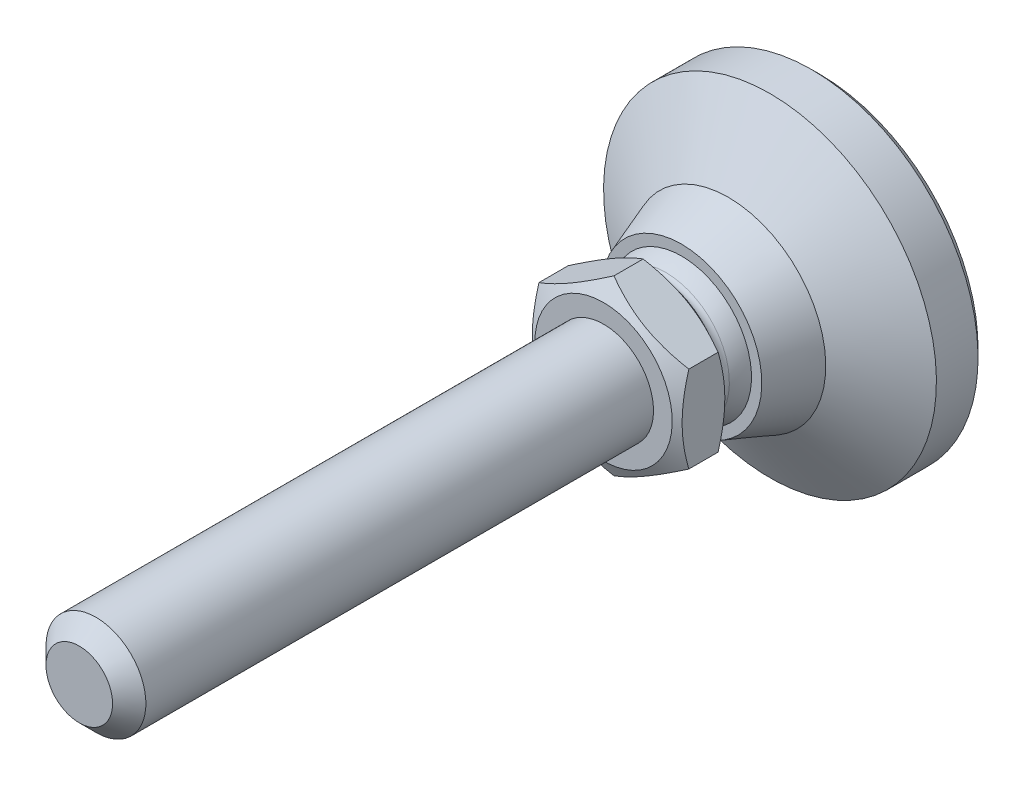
ISO-10303-21;
HEADER;
FILE_DESCRIPTION(('STEP AP214'),'2;1');
FILE_NAME('part.step','',(''),(''),'','','');
FILE_SCHEMA(('AUTOMOTIVE_DESIGN { 1 0 10303 214 1 1 1 1 }'));
ENDSEC;
DATA;
#1=APPLICATION_CONTEXT('core data for automotive mechanical design processes');
#2=APPLICATION_PROTOCOL_DEFINITION('international standard','automotive_design',2000,#1);
#3=PRODUCT_CONTEXT('',#1,'mechanical');
#4=PRODUCT('Part','Part','',(#3));
#5=PRODUCT_RELATED_PRODUCT_CATEGORY('part','',(#4));
#6=PRODUCT_DEFINITION_FORMATION('','',#4);
#7=PRODUCT_DEFINITION_CONTEXT('part definition',#1,'design');
#8=PRODUCT_DEFINITION('design','',#6,#7);
#9=PRODUCT_DEFINITION_SHAPE('','',#8);
#10=(LENGTH_UNIT() NAMED_UNIT(*) SI_UNIT(.MILLI.,.METRE.));
#11=(NAMED_UNIT(*) PLANE_ANGLE_UNIT() SI_UNIT($,.RADIAN.));
#12=(NAMED_UNIT(*) SI_UNIT($,.STERADIAN.) SOLID_ANGLE_UNIT());
#13=UNCERTAINTY_MEASURE_WITH_UNIT(LENGTH_MEASURE(1.E-05),#10,'distance_accuracy_value','');
#14=(GEOMETRIC_REPRESENTATION_CONTEXT(3) GLOBAL_UNCERTAINTY_ASSIGNED_CONTEXT((#13)) GLOBAL_UNIT_ASSIGNED_CONTEXT((#10,
#11,#12)) REPRESENTATION_CONTEXT('',''));
#15=CARTESIAN_POINT('',(0.,0.,0.));
#16=DIRECTION('',(0.,0.,1.));
#17=DIRECTION('',(1.,0.,0.));
#18=AXIS2_PLACEMENT_3D('',#15,#16,#17);
#19=CARTESIAN_POINT('',(0.,0.,19.0000000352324));
#20=DIRECTION('',(0.,0.,-1.));
#21=DIRECTION('',(0.,1.,0.));
#22=AXIS2_PLACEMENT_3D('',#19,#20,#21);
#23=TOROIDAL_SURFACE('',#22,8.5000000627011,1.);
#24=CARTESIAN_POINT('',(0.,0.,18.5101289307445));
#25=DIRECTION('',(0.,0.,-1.));
#26=DIRECTION('',(0.,1.,0.));
#27=AXIS2_PLACEMENT_3D('',#24,#25,#26);
#28=CIRCLE('',#27,7.62820518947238);
#29=CARTESIAN_POINT('',(-7.62820518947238,0.,18.5101289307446));
#30=VERTEX_POINT('',#29);
#31=EDGE_CURVE('E73',#30,#30,#28,.T.);
#32=ORIENTED_EDGE('',*,*,#31,.F.);
#33=EDGE_LOOP('',(#32));
#34=FACE_BOUND('',#33,.T.);
#35=CARTESIAN_POINT('',(0.,0.,20.0000000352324));
#36=DIRECTION('',(0.,0.,-1.));
#37=DIRECTION('',(0.,1.,0.));
#38=AXIS2_PLACEMENT_3D('',#35,#36,#37);
#39=CIRCLE('',#38,8.5000000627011);
#40=CARTESIAN_POINT('',(0.,8.5000000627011,20.0000000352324));
#41=VERTEX_POINT('',#40);
#42=EDGE_CURVE('E78',#41,#41,#39,.F.);
#43=ORIENTED_EDGE('',*,*,#42,.F.);
#44=EDGE_LOOP('',(#43));
#45=FACE_BOUND('',#44,.T.);
#46=ADVANCED_FACE('F14',(#34,#45),#23,.F.);
#47=CARTESIAN_POINT('',(0.,0.,14.223757));
#48=DIRECTION('',(0.,0.,-1.));
#49=DIRECTION('',(-1.,0.,0.));
#50=AXIS2_PLACEMENT_3D('',#47,#48,#49);
#51=SPHERICAL_SURFACE('',#50,8.74999992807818);
#52=CARTESIAN_POINT('',(0.,0.,16.635983));
#53=DIRECTION('',(0.,0.,-1.));
#54=DIRECTION('',(0.,1.,0.));
#55=AXIS2_PLACEMENT_3D('',#52,#53,#54);
#56=CIRCLE('',#55,8.41092530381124);
#57=CARTESIAN_POINT('',(-8.41092530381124,0.,16.635983));
#58=VERTEX_POINT('',#57);
#59=EDGE_CURVE('E109',#58,#58,#56,.T.);
#60=CARTESIAN_POINT('',(-8.41092530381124,0.,16.635983));
#61=CARTESIAN_POINT('',(-8.40507963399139,0.,16.6563656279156));
#62=CARTESIAN_POINT('',(-8.39915987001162,0.,16.6767270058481));
#63=CARTESIAN_POINT('',(-8.38717247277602,0.,16.7174061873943));
#64=CARTESIAN_POINT('',(-8.38110483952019,0.,16.7377239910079));
#65=CARTESIAN_POINT('',(-8.36882202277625,0.,16.7783149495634));
#66=CARTESIAN_POINT('',(-8.36260683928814,0.,16.7985881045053));
#67=CARTESIAN_POINT('',(-8.35002925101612,0.,16.8390886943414));
#68=CARTESIAN_POINT('',(-8.34366684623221,0.,16.8593161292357));
#69=CARTESIAN_POINT('',(-8.33079515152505,0.,16.8997242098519));
#70=CARTESIAN_POINT('',(-8.32428586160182,0.,16.9199048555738));
#71=CARTESIAN_POINT('',(-8.31112074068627,0.,16.9602182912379));
#72=CARTESIAN_POINT('',(-8.30446490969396,0.,16.98035108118));
#73=CARTESIAN_POINT('',(-8.29100705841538,0.,17.0205677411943));
#74=CARTESIAN_POINT('',(-8.28420503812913,0.,17.0406516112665));
#75=CARTESIAN_POINT('',(-8.27045516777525,0.,17.0807693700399));
#76=CARTESIAN_POINT('',(-8.26350731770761,0.,17.1008032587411));
#77=CARTESIAN_POINT('',(-8.24946615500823,0.,17.1408199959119));
#78=CARTESIAN_POINT('',(-8.24237284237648,0.,17.1608028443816));
#79=CARTESIAN_POINT('',(-8.2280411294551,0.,17.2007164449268));
#80=CARTESIAN_POINT('',(-8.22080272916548,0.,17.2206471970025));
#81=CARTESIAN_POINT('',(-8.20618122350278,0.,17.2604555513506));
#82=CARTESIAN_POINT('',(-8.1987981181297,0.,17.280333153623));
#83=CARTESIAN_POINT('',(-8.18388759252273,0.,17.3200341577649));
#84=CARTESIAN_POINT('',(-8.17636017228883,0.,17.3398575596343));
#85=CARTESIAN_POINT('',(-8.16116141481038,0.,17.3794491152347));
#86=CARTESIAN_POINT('',(-8.15349007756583,0.,17.3992172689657));
#87=CARTESIAN_POINT('',(-8.13800389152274,0.,17.4386972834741));
#88=CARTESIAN_POINT('',(-8.13018904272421,0.,17.4584091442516));
#89=CARTESIAN_POINT('',(-8.11441624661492,0.,17.4977755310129));
#90=CARTESIAN_POINT('',(-8.10645829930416,0.,17.5174300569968));
#91=CARTESIAN_POINT('',(-8.09039972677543,0.,17.5566807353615));
#92=CARTESIAN_POINT('',(-8.08229910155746,0.,17.5762768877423));
#93=CARTESIAN_POINT('',(-8.06595560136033,0.,17.6154097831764));
#94=CARTESIAN_POINT('',(-8.05771272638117,0.,17.6349465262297));
#95=CARTESIAN_POINT('',(-8.04108516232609,0.,17.6739595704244));
#96=CARTESIAN_POINT('',(-8.03270047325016,0.,17.6934358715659));
#97=CARTESIAN_POINT('',(-8.01578972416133,0.,17.7323270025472));
#98=CARTESIAN_POINT('',(-8.00726366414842,0.,17.751741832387));
#99=CARTESIAN_POINT('',(-7.99007062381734,0.,17.7905089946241));
#100=CARTESIAN_POINT('',(-7.98140364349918,0.,17.8098613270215));
#101=CARTESIAN_POINT('',(-7.96392922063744,0.,17.8485024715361));
#102=CARTESIAN_POINT('',(-7.95512177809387,0.,17.8677912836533));
#103=CARTESIAN_POINT('',(-7.93736689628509,0.,17.9063043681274));
#104=CARTESIAN_POINT('',(-7.92841945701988,0.,17.9255286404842));
#105=CARTESIAN_POINT('',(-7.91038505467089,0.,17.9639116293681));
#106=CARTESIAN_POINT('',(-7.90129809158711,0.,17.9830703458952));
#107=CARTESIAN_POINT('',(-7.88298512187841,0.,18.0213212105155));
#108=CARTESIAN_POINT('',(-7.8737591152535,0.,18.0404133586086));
#109=CARTESIAN_POINT('',(-7.85516854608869,0.,18.0785300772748));
#110=CARTESIAN_POINT('',(-7.84580398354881,0.,18.0975546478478));
#111=CARTESIAN_POINT('',(-7.82693679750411,0.,18.1355352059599));
#112=CARTESIAN_POINT('',(-7.8174341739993,0.,18.1544911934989));
#113=CARTESIAN_POINT('',(-7.79829136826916,0.,18.1923335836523));
#114=CARTESIAN_POINT('',(-7.78865118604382,0.,18.2112199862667));
#115=CARTESIAN_POINT('',(-7.76923377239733,0.,18.2489222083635));
#116=CARTESIAN_POINT('',(-7.75945654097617,0.,18.267738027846));
#117=CARTESIAN_POINT('',(-7.73976554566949,0.,18.3052980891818));
#118=CARTESIAN_POINT('',(-7.72985178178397,0.,18.3240423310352));
#119=CARTESIAN_POINT('',(-7.70988824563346,0.,18.3614582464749));
#120=CARTESIAN_POINT('',(-7.69983847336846,0.,18.3801299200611));
#121=CARTESIAN_POINT('',(-7.67960345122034,0.,18.4173997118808));
#122=CARTESIAN_POINT('',(-7.6694182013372,0.,18.4359978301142));
#123=CARTESIAN_POINT('',(-7.6489127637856,0.,18.4731195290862));
#124=CARTESIAN_POINT('',(-7.63859257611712,0.,18.4916431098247));
#125=CARTESIAN_POINT('',(-7.62820518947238,0.,18.5101289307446));
#126=B_SPLINE_CURVE_WITH_KNOTS('',3,(#60,#61,#62,#63,#64,#65,#66,#67,#68,#69,#70,#71,#72,#73,
#74,#75,#76,#77,#78,#79,#80,#81,#82,#83,#84,#85,#86,#87,#88,#89,#90,#91,#92,#93,#94,#95,#96,#97,
#98,#99,#100,#101,#102,#103,#104,#105,#106,#107,#108,#109,#110,#111,#112,#113,#114,#115,#116,
#117,#118,#119,#120,#121,#122,#123,#124,#125),.UNSPECIFIED.,.F.,.F.,(4,2,2,2,2,2,2,2,2,2,2,2,2,
2,2,2,2,2,2,2,2,2,2,2,2,2,2,2,2,2,2,2,4),(0.,0.0636128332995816,0.127225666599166,
0.190838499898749,0.254451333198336,0.318064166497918,0.381676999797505,0.445289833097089,
0.508902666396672,0.572515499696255,0.636128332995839,0.699741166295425,0.763353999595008,
0.826966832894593,0.890579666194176,0.95419249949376,1.01780533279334,1.08141816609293,
1.14503099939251,1.2086438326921,1.27225666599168,1.33586949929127,1.39948233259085,
1.46309516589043,1.52670799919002,1.5903208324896,1.65393366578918,1.71754649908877,
1.78115933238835,1.84477216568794,1.90838499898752,1.97199783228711,2.03561066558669),.UNSPECIFIED.);
#127=EDGE_CURVE('BSEAM224',#58,#30,#126,.T.);
#128=ORIENTED_EDGE('',*,*,#59,.F.);
#129=ORIENTED_EDGE('',*,*,#31,.T.);
#130=ORIENTED_EDGE('',*,*,#127,.T.);
#131=ORIENTED_EDGE('',*,*,#127,.F.);
#132=EDGE_LOOP('',(#128,#130,#129,#131));
#133=FACE_BOUND('',#132,.T.);
#134=ADVANCED_FACE('F224',(#133),#51,.T.);
#135=CARTESIAN_POINT('',(-8.41092530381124,0.,16.635983));
#136=DIRECTION('',(0.,0.,-1.));
#137=DIRECTION('',(0.,1.,0.));
#138=AXIS2_PLACEMENT_3D('',#135,#136,#137);
#139=PLANE('',#138);
#140=CARTESIAN_POINT('',(0.,0.,16.635983));
#141=DIRECTION('',(0.,0.,-1.));
#142=DIRECTION('',(0.,1.,0.));
#143=AXIS2_PLACEMENT_3D('',#140,#141,#142);
#144=CIRCLE('',#143,9.649999);
#145=CARTESIAN_POINT('',(0.,9.649999,16.635983));
#146=VERTEX_POINT('',#145);
#147=EDGE_CURVE('E106',#146,#146,#144,.T.);
#148=ORIENTED_EDGE('',*,*,#147,.F.);
#149=EDGE_LOOP('',(#148));
#150=FACE_BOUND('',#149,.T.);
#151=ORIENTED_EDGE('',*,*,#59,.T.);
#152=EDGE_LOOP('',(#151));
#153=FACE_BOUND('',#152,.T.);
#154=ADVANCED_FACE('F220',(#150,#153),#139,.F.);
#155=CARTESIAN_POINT('',(0.,0.,16.635983));
#156=DIRECTION('',(0.,0.,-1.));
#157=DIRECTION('',(0.,1.,0.));
#158=AXIS2_PLACEMENT_3D('',#155,#156,#157);
#159=CONICAL_SURFACE('',#158,9.649999,0.349065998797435);
#160=CARTESIAN_POINT('',(0.,0.,11.));
#161=DIRECTION('',(0.,0.,-1.));
#162=DIRECTION('',(0.,1.,0.));
#163=AXIS2_PLACEMENT_3D('',#160,#161,#162);
#164=CIRCLE('',#163,11.70133);
#165=CARTESIAN_POINT('',(0.,11.70133,11.));
#166=VERTEX_POINT('',#165);
#167=EDGE_CURVE('E103',#166,#166,#164,.T.);
#168=ORIENTED_EDGE('',*,*,#167,.F.);
#169=EDGE_LOOP('',(#168));
#170=FACE_BOUND('',#169,.T.);
#171=ORIENTED_EDGE('',*,*,#147,.T.);
#172=EDGE_LOOP('',(#171));
#173=FACE_BOUND('',#172,.T.);
#174=ADVANCED_FACE('F216',(#170,#173),#159,.T.);
#175=CARTESIAN_POINT('',(0.,0.,11.));
#176=DIRECTION('',(0.,0.,-1.));
#177=DIRECTION('',(0.,1.,0.));
#178=AXIS2_PLACEMENT_3D('',#175,#176,#177);
#179=CONICAL_SURFACE('',#178,11.70133,1.02853608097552);
#180=CARTESIAN_POINT('',(0.,0.,6.));
#181=DIRECTION('',(0.,0.,-1.));
#182=DIRECTION('',(0.,1.,0.));
#183=AXIS2_PLACEMENT_3D('',#180,#181,#182);
#184=CIRCLE('',#183,20.);
#185=CARTESIAN_POINT('',(0.,20.,6.));
#186=VERTEX_POINT('',#185);
#187=EDGE_CURVE('E100',#186,#186,#184,.T.);
#188=ORIENTED_EDGE('',*,*,#187,.F.);
#189=EDGE_LOOP('',(#188));
#190=FACE_BOUND('',#189,.T.);
#191=ORIENTED_EDGE('',*,*,#167,.T.);
#192=EDGE_LOOP('',(#191));
#193=FACE_BOUND('',#192,.T.);
#194=ADVANCED_FACE('F212',(#190,#193),#179,.T.);
#195=CARTESIAN_POINT('',(0.,0.,0.));
#196=DIRECTION('',(0.,0.,-1.));
#197=DIRECTION('',(0.,1.,0.));
#198=AXIS2_PLACEMENT_3D('',#195,#196,#197);
#199=CYLINDRICAL_SURFACE('',#198,20.);
#200=CARTESIAN_POINT('',(0.,0.,1.));
#201=DIRECTION('',(0.,0.,-1.));
#202=DIRECTION('',(0.,1.,0.));
#203=AXIS2_PLACEMENT_3D('',#200,#201,#202);
#204=CIRCLE('',#203,20.);
#205=CARTESIAN_POINT('',(0.,20.,1.));
#206=VERTEX_POINT('',#205);
#207=EDGE_CURVE('E97',#206,#206,#204,.T.);
#208=ORIENTED_EDGE('',*,*,#207,.F.);
#209=EDGE_LOOP('',(#208));
#210=FACE_BOUND('',#209,.T.);
#211=ORIENTED_EDGE('',*,*,#187,.T.);
#212=EDGE_LOOP('',(#211));
#213=FACE_BOUND('',#212,.T.);
#214=ADVANCED_FACE('F208',(#210,#213),#199,.T.);
#215=CARTESIAN_POINT('',(0.,0.,1.));
#216=DIRECTION('',(0.,0.,1.));
#217=DIRECTION('',(0.,-1.,0.));
#218=AXIS2_PLACEMENT_3D('',#215,#216,#217);
#219=CONICAL_SURFACE('',#218,20.,0.785398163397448);
#220=CARTESIAN_POINT('',(0.,0.,0.));
#221=DIRECTION('',(0.,0.,-1.));
#222=DIRECTION('',(0.,1.,0.));
#223=AXIS2_PLACEMENT_3D('',#220,#221,#222);
#224=CIRCLE('',#223,19.);
#225=CARTESIAN_POINT('',(0.,19.,0.));
#226=VERTEX_POINT('',#225);
#227=EDGE_CURVE('E94',#226,#226,#224,.T.);
#228=ORIENTED_EDGE('',*,*,#227,.F.);
#229=EDGE_LOOP('',(#228));
#230=FACE_BOUND('',#229,.T.);
#231=ORIENTED_EDGE('',*,*,#207,.T.);
#232=EDGE_LOOP('',(#231));
#233=FACE_BOUND('',#232,.T.);
#234=ADVANCED_FACE('F204',(#230,#233),#219,.T.);
#235=CARTESIAN_POINT('',(0.,0.,0.));
#236=DIRECTION('',(0.,0.,1.));
#237=DIRECTION('',(0.,-1.,0.));
#238=AXIS2_PLACEMENT_3D('',#235,#236,#237);
#239=PLANE('',#238);
#240=ORIENTED_EDGE('',*,*,#227,.T.);
#241=EDGE_LOOP('',(#240));
#242=FACE_BOUND('',#241,.T.);
#243=ADVANCED_FACE('F200',(#242),#239,.F.);
#244=CARTESIAN_POINT('',(0.,8.25,20.0000000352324));
#245=DIRECTION('',(0.,0.,-1.));
#246=DIRECTION('',(0.,1.,0.));
#247=AXIS2_PLACEMENT_3D('',#244,#245,#246);
#248=PLANE('',#247);
#249=ORIENTED_EDGE('',*,*,#42,.T.);
#250=EDGE_LOOP('',(#249));
#251=FACE_BOUND('',#250,.T.);
#252=CARTESIAN_POINT('',(0.,0.,20.0000000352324));
#253=DIRECTION('',(0.,0.,-1.));
#254=DIRECTION('',(0.,1.,0.));
#255=AXIS2_PLACEMENT_3D('',#252,#253,#254);
#256=CIRCLE('',#255,8.25);
#257=CARTESIAN_POINT('',(0.,8.25,20.0000000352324));
#258=VERTEX_POINT('',#257);
#259=EDGE_CURVE('E292',#258,#258,#256,.T.);
#260=ORIENTED_EDGE('',*,*,#259,.T.);
#261=EDGE_LOOP('',(#260));
#262=FACE_BOUND('',#261,.T.);
#263=ADVANCED_FACE('F129',(#251,#262),#248,.F.);
#264=CARTESIAN_POINT('',(0.,0.,22.0957582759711));
#265=DIRECTION('',(0.,0.,1.));
#266=DIRECTION('',(0.,-1.,0.));
#267=AXIS2_PLACEMENT_3D('',#264,#265,#266);
#268=CONICAL_SURFACE('',#267,11.8799597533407,1.0471975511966);
#269=CARTESIAN_POINT('',(0.000200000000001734,-10.4000990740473,21.2413603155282));
#270=CARTESIAN_POINT('',(-0.197753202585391,-10.2858107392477,21.1753793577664));
#271=CARTESIAN_POINT('',(-0.396478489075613,-10.1710766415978,21.1123922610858));
#272=CARTESIAN_POINT('',(-0.795542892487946,-9.94067670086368,20.9932318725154));
#273=CARTESIAN_POINT('',(-0.995882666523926,-9.82501047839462,20.9370615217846));
#274=CARTESIAN_POINT('',(-1.39854780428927,-9.59253165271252,20.8322960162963));
#275=CARTESIAN_POINT('',(-1.60087672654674,-9.47571699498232,20.7837189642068));
#276=CARTESIAN_POINT('',(-2.00691067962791,-9.24129318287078,20.6951913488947));
#277=CARTESIAN_POINT('',(-2.21061542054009,-9.12368419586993,20.655239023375));
#278=CARTESIAN_POINT('',(-2.61423624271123,-8.89065360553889,20.5856466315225));
#279=CARTESIAN_POINT('',(-2.81412251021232,-8.77524921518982,20.5557774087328));
#280=CARTESIAN_POINT('',(-3.21478942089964,-8.54392406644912,20.5056962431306));
#281=CARTESIAN_POINT('',(-3.41556998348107,-8.42800335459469,20.4854834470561));
#282=CARTESIAN_POINT('',(-3.81747936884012,-8.19596086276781,20.4552200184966));
#283=CARTESIAN_POINT('',(-4.01860753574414,-8.07983946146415,20.4451578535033));
#284=CARTESIAN_POINT('',(-4.4210489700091,-7.84748979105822,20.4354133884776));
#285=CARTESIAN_POINT('',(-4.62236223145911,-7.73126152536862,20.4357307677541));
#286=CARTESIAN_POINT('',(-4.99872349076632,-7.51396925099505,20.4460228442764));
#287=CARTESIAN_POINT('',(-5.17379802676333,-7.41288992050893,20.4547420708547));
#288=CARTESIAN_POINT('',(-5.52353701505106,-7.2109680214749,20.4798612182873));
#289=CARTESIAN_POINT('',(-5.69820143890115,-7.1101254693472,20.4962616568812));
#290=CARTESIAN_POINT('',(-6.2215185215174,-6.80798821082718,20.5565970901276));
#291=CARTESIAN_POINT('',(-6.56924487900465,-6.60722830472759,20.6116586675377));
#292=CARTESIAN_POINT('',(-7.26838615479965,-6.20357890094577,20.7493132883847));
#293=CARTESIAN_POINT('',(-7.61971184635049,-6.00074091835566,20.8324898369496));
#294=CARTESIAN_POINT('',(-8.31712409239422,-5.59808977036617,21.0212661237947));
#295=CARTESIAN_POINT('',(-8.66321957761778,-5.39827144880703,21.1268215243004));
#296=CARTESIAN_POINT('',(-9.00685,-5.19987633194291,21.2413603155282));
#297=B_SPLINE_CURVE_WITH_KNOTS('',3,(#269,#270,#271,#272,#273,#274,#275,#276,#277,#278,#279,
#280,#281,#282,#283,#284,#285,#286,#287,#288,#289,#290,#291,#292,#293,#294,#295,#296),
.UNSPECIFIED.,.F.,.F.,(4,2,2,2,2,2,2,2,2,2,2,2,2,4),(0.,0.713746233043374,1.42779933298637,
2.14352961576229,2.85911351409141,3.55712384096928,4.25507247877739,4.95222725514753,
5.64936049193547,6.25624894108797,6.86317830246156,8.07790154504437,9.31956468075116,
10.5587904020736),.UNSPECIFIED.);
#298=CARTESIAN_POINT('',(0.,-10.3999836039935,21.2412936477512));
#299=VERTEX_POINT('',#298);
#300=CARTESIAN_POINT('',(-9.00665,-5.19999180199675,21.2412936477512));
#301=VERTEX_POINT('',#300);
#302=EDGE_CURVE('E69',#299,#301,#297,.T.);
#303=ORIENTED_EDGE('',*,*,#302,.T.);
#304=CARTESIAN_POINT('',(-9.00665,13.8491525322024,24.7748330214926));
#305=CARTESIAN_POINT('',(-9.00665,13.6529524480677,24.6798739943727));
#306=CARTESIAN_POINT('',(-9.00665,13.4565188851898,24.5853975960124));
#307=CARTESIAN_POINT('',(-9.00665,13.063136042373,24.3975196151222));
#308=CARTESIAN_POINT('',(-9.00665,12.8661867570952,24.3041180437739));
#309=CARTESIAN_POINT('',(-9.00665,12.2744380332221,24.0256644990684));
#310=CARTESIAN_POINT('',(-9.00665,11.8787976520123,23.8423927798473));
#311=CARTESIAN_POINT('',(-9.00665,11.0826184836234,23.4807156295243));
#312=CARTESIAN_POINT('',(-9.00665,10.6820646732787,23.3023431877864));
#313=CARTESIAN_POINT('',(-9.00665,9.87772983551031,22.9530559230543));
#314=CARTESIAN_POINT('',(-9.00665,9.47394896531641,22.7821407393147));
#315=CARTESIAN_POINT('',(-9.00665,8.64997928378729,22.4446097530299));
#316=CARTESIAN_POINT('',(-9.00665,8.22966872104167,22.2782895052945));
#317=CARTESIAN_POINT('',(-9.00665,7.38408776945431,21.9585263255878));
#318=CARTESIAN_POINT('',(-9.00665,6.95881682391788,21.8050848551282));
#319=CARTESIAN_POINT('',(-9.00665,6.10346833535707,21.5151952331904));
#320=CARTESIAN_POINT('',(-9.00665,5.67340293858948,21.3787116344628));
#321=CARTESIAN_POINT('',(-9.00665,4.80712089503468,21.1271930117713));
#322=CARTESIAN_POINT('',(-9.00665,4.3709062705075,21.0121511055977));
#323=CARTESIAN_POINT('',(-9.00665,3.49438688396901,20.8097236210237));
#324=CARTESIAN_POINT('',(-9.00665,3.05411642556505,20.7221935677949));
#325=CARTESIAN_POINT('',(-9.00665,2.38979835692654,20.615383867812));
#326=CARTESIAN_POINT('',(-9.00665,2.16768975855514,20.5838600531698));
#327=CARTESIAN_POINT('',(-9.00665,1.72240940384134,20.5295950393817));
#328=CARTESIAN_POINT('',(-9.00665,1.49923775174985,20.5068529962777));
#329=CARTESIAN_POINT('',(-9.00665,1.05499371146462,20.4708838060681));
#330=CARTESIAN_POINT('',(-9.00665,0.833930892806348,20.4575389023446));
#331=CARTESIAN_POINT('',(-9.00665,0.391439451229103,20.4402006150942));
#332=CARTESIAN_POINT('',(-9.00665,0.170010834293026,20.436207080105));
#333=CARTESIAN_POINT('',(-9.00665,-0.272818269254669,20.4376665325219));
#334=CARTESIAN_POINT('',(-9.00665,-0.494218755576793,20.4431196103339));
#335=CARTESIAN_POINT('',(-9.00665,-0.936596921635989,20.4633413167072));
#336=CARTESIAN_POINT('',(-9.00665,-1.15757457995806,20.4781104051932));
#337=CARTESIAN_POINT('',(-9.00665,-1.6922796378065,20.5248102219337));
#338=CARTESIAN_POINT('',(-9.00665,-2.00561024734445,20.5613621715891));
#339=CARTESIAN_POINT('',(-9.00665,-2.62986909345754,20.6511766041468));
#340=CARTESIAN_POINT('',(-9.00665,-2.94079698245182,20.7044414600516));
#341=CARTESIAN_POINT('',(-9.00665,-3.55997983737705,20.8257866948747));
#342=CARTESIAN_POINT('',(-9.00665,-3.86823245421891,20.8938789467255));
#343=CARTESIAN_POINT('',(-9.00665,-4.4816085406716,21.0428084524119));
#344=CARTESIAN_POINT('',(-9.00665,-4.78673206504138,21.1236454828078));
#345=CARTESIAN_POINT('',(-9.00665,-5.40052789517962,21.2980067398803));
#346=CARTESIAN_POINT('',(-9.00665,-5.7091319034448,21.3917697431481));
#347=CARTESIAN_POINT('',(-9.00665,-6.32329860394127,21.5887271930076));
#348=CARTESIAN_POINT('',(-9.00665,-6.62886127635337,21.6919217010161));
#349=CARTESIAN_POINT('',(-9.00665,-7.23710115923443,21.906126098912));
#350=CARTESIAN_POINT('',(-9.00665,-7.53977934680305,22.0171332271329));
#351=CARTESIAN_POINT('',(-9.00665,-8.14264446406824,22.2456820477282));
#352=CARTESIAN_POINT('',(-9.00665,-8.44283142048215,22.3632236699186));
#353=CARTESIAN_POINT('',(-9.00665,-9.14127613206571,22.6440740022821));
#354=CARTESIAN_POINT('',(-9.00665,-9.5386747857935,22.8095157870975));
#355=CARTESIAN_POINT('',(-9.00665,-10.3301967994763,23.14807854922));
#356=CARTESIAN_POINT('',(-9.00665,-10.7243199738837,23.3211999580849));
#357=CARTESIAN_POINT('',(-9.00665,-11.5098898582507,23.673608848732));
#358=CARTESIAN_POINT('',(-9.00665,-11.9013360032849,23.8528975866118));
#359=CARTESIAN_POINT('',(-9.00665,-12.6819110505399,24.216419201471));
#360=CARTESIAN_POINT('',(-9.00665,-13.0710399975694,24.4006519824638));
#361=CARTESIAN_POINT('',(-9.00665,-13.847756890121,24.7733413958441));
#362=CARTESIAN_POINT('',(-9.00665,-14.23534285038,24.9618021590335));
#363=CARTESIAN_POINT('',(-9.00665,-15.0088768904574,25.3420585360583));
#364=CARTESIAN_POINT('',(-9.00665,-15.3948249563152,25.5338541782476));
#365=CARTESIAN_POINT('',(-9.00665,-16.5505030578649,26.1133231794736));
#366=CARTESIAN_POINT('',(-9.00665,-17.3181628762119,26.5051249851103));
#367=CARTESIAN_POINT('',(-9.00665,-18.7870199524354,27.2642484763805));
#368=CARTESIAN_POINT('',(-9.00665,-19.4885330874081,27.630961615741));
#369=CARTESIAN_POINT('',(-9.00665,-20.8889669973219,28.3693561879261));
#370=CARTESIAN_POINT('',(-9.00665,-21.5878876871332,28.7410377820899));
#371=CARTESIAN_POINT('',(-9.00665,-22.9820622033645,29.4873185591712));
#372=CARTESIAN_POINT('',(-9.00665,-23.6773207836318,29.8619088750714));
#373=CARTESIAN_POINT('',(-9.00665,-25.0661752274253,30.6140748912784));
#374=CARTESIAN_POINT('',(-9.00665,-25.7597711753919,30.9916504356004));
#375=CARTESIAN_POINT('',(-9.00665,-26.4527522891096,31.3703435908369));
#376=B_SPLINE_CURVE_WITH_KNOTS('',3,(#304,#305,#306,#307,#308,#309,#310,#311,#312,#313,#314,
#315,#316,#317,#318,#319,#320,#321,#322,#323,#324,#325,#326,#327,#328,#329,#330,#331,#332,#333,
#334,#335,#336,#337,#338,#339,#340,#341,#342,#343,#344,#345,#346,#347,#348,#349,#350,#351,#352,
#353,#354,#355,#356,#357,#358,#359,#360,#361,#362,#363,#364,#365,#366,#367,#368,#369,#370,#371,
#372,#373,#374,#375),.UNSPECIFIED.,.F.,.F.,(4,2,2,2,2,2,2,2,2,2,2,2,2,2,2,2,2,2,2,2,2,2,2,2,2,2,
2,2,2,2,2,2,2,2,2,4),(0.,0.653914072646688,1.30783494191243,2.61587650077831,3.93124134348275,
5.24654248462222,6.60244326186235,7.95849770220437,9.31166809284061,10.6644034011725,
12.009911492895,12.6827687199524,13.3555612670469,14.0197652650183,14.6839585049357,
15.3481581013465,16.0123904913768,16.9582307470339,17.9042053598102,18.8509402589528,
19.7976585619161,20.765078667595,21.7325050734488,22.6995912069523,23.6666669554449,
24.957941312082,26.2492883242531,27.5408999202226,28.832486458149,30.1253951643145,
31.4183148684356,34.003834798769,36.3785540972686,38.7533506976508,41.1225878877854,
43.491702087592),.UNSPECIFIED.);
#377=CARTESIAN_POINT('',(-9.00665,5.19999180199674,21.2412936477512));
#378=VERTEX_POINT('',#377);
#379=EDGE_CURVE('E79',#301,#378,#376,.F.);
#380=ORIENTED_EDGE('',*,*,#379,.T.);
#381=CARTESIAN_POINT('',(-9.00685,5.1998763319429,21.2413603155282));
#382=CARTESIAN_POINT('',(-8.80889679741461,5.31416466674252,21.1753793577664));
#383=CARTESIAN_POINT('',(-8.61017151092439,5.42889876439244,21.1123922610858));
#384=CARTESIAN_POINT('',(-8.21110710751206,5.65929870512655,20.9932318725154));
#385=CARTESIAN_POINT('',(-8.01076733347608,5.77496492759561,20.9370615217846));
#386=CARTESIAN_POINT('',(-7.60810219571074,6.0074437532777,20.8322960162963));
#387=CARTESIAN_POINT('',(-7.40577327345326,6.1242584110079,20.7837189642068));
#388=CARTESIAN_POINT('',(-6.99973932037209,6.35868222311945,20.6951913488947));
#389=CARTESIAN_POINT('',(-6.79603457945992,6.47629121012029,20.655239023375));
#390=CARTESIAN_POINT('',(-6.39241375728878,6.70932180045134,20.5856466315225));
#391=CARTESIAN_POINT('',(-6.19252748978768,6.8247261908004,20.5557774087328));
#392=CARTESIAN_POINT('',(-5.79186057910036,7.05605133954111,20.5056962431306));
#393=CARTESIAN_POINT('',(-5.59108001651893,7.17197205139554,20.485483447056));
#394=CARTESIAN_POINT('',(-5.18917063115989,7.40401454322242,20.4552200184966));
#395=CARTESIAN_POINT('',(-4.98804246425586,7.52013594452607,20.4451578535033));
#396=CARTESIAN_POINT('',(-4.5856010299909,7.75248561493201,20.4354133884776));
#397=CARTESIAN_POINT('',(-4.38428776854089,7.86871388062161,20.4357307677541));
#398=CARTESIAN_POINT('',(-4.00792650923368,8.08600615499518,20.4460228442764));
#399=CARTESIAN_POINT('',(-3.83285197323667,8.1870854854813,20.4547420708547));
#400=CARTESIAN_POINT('',(-3.48311298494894,8.38900738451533,20.4798612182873));
#401=CARTESIAN_POINT('',(-3.30844856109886,8.48984993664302,20.4962616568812));
#402=CARTESIAN_POINT('',(-2.7851314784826,8.79198719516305,20.5565970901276));
#403=CARTESIAN_POINT('',(-2.43740512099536,8.99274710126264,20.6116586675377));
#404=CARTESIAN_POINT('',(-1.73826384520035,9.39639650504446,20.7493132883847));
#405=CARTESIAN_POINT('',(-1.38693815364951,9.59923448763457,20.8324898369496));
#406=CARTESIAN_POINT('',(-0.689525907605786,10.0018856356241,21.0212661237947));
#407=CARTESIAN_POINT('',(-0.343430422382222,10.2017039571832,21.1268215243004));
#408=CARTESIAN_POINT('',(0.000199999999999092,10.4000990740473,21.2413603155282));
#409=B_SPLINE_CURVE_WITH_KNOTS('',3,(#381,#382,#383,#384,#385,#386,#387,#388,#389,#390,#391,
#392,#393,#394,#395,#396,#397,#398,#399,#400,#401,#402,#403,#404,#405,#406,#407,#408),
.UNSPECIFIED.,.F.,.F.,(4,2,2,2,2,2,2,2,2,2,2,2,2,4),(0.,0.713746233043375,1.42779933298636,
2.14352961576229,2.85911351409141,3.55712384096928,4.25507247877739,4.95222725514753,
5.64936049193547,6.25624894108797,6.86317830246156,8.07790154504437,9.31956468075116,
10.5587904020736),.UNSPECIFIED.);
#410=CARTESIAN_POINT('',(0.,10.3999836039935,21.2412936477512));
#411=VERTEX_POINT('',#410);
#412=EDGE_CURVE('E152',#378,#411,#409,.T.);
#413=ORIENTED_EDGE('',*,*,#412,.T.);
#414=CARTESIAN_POINT('',(-0.000200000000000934,10.4000990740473,21.2413603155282));
#415=CARTESIAN_POINT('',(0.197753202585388,10.2858107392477,21.1753793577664));
#416=CARTESIAN_POINT('',(0.396478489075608,10.1710766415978,21.1123922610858));
#417=CARTESIAN_POINT('',(0.795542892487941,9.94067670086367,20.9932318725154));
#418=CARTESIAN_POINT('',(0.995882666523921,9.82501047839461,20.9370615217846));
#419=CARTESIAN_POINT('',(1.39854780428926,9.59253165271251,20.8322960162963));
#420=CARTESIAN_POINT('',(1.60087672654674,9.47571699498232,20.7837189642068));
#421=CARTESIAN_POINT('',(2.00691067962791,9.24129318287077,20.6951913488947));
#422=CARTESIAN_POINT('',(2.21061542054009,9.12368419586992,20.655239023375));
#423=CARTESIAN_POINT('',(2.61423624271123,8.89065360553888,20.5856466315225));
#424=CARTESIAN_POINT('',(2.81412251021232,8.77524921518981,20.5557774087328));
#425=CARTESIAN_POINT('',(3.21478942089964,8.54392406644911,20.5056962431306));
#426=CARTESIAN_POINT('',(3.41556998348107,8.42800335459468,20.485483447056));
#427=CARTESIAN_POINT('',(3.81747936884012,8.1959608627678,20.4552200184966));
#428=CARTESIAN_POINT('',(4.01860753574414,8.07983946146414,20.4451578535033));
#429=CARTESIAN_POINT('',(4.4210489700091,7.84748979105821,20.4354133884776));
#430=CARTESIAN_POINT('',(4.62236223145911,7.73126152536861,20.4357307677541));
#431=CARTESIAN_POINT('',(4.99872349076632,7.51396925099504,20.4460228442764));
#432=CARTESIAN_POINT('',(5.17379802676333,7.41288992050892,20.4547420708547));
#433=CARTESIAN_POINT('',(5.52353701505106,7.21096802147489,20.4798612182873));
#434=CARTESIAN_POINT('',(5.69820143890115,7.11012546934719,20.4962616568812));
#435=CARTESIAN_POINT('',(6.2215185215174,6.80798821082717,20.5565970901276));
#436=CARTESIAN_POINT('',(6.56924487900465,6.60722830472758,20.6116586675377));
#437=CARTESIAN_POINT('',(7.26838615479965,6.20357890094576,20.7493132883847));
#438=CARTESIAN_POINT('',(7.61971184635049,6.00074091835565,20.8324898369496));
#439=CARTESIAN_POINT('',(8.31712409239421,5.59808977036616,21.0212661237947));
#440=CARTESIAN_POINT('',(8.66321957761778,5.39827144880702,21.1268215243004));
#441=CARTESIAN_POINT('',(9.00685,5.1998763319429,21.2413603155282));
#442=B_SPLINE_CURVE_WITH_KNOTS('',3,(#414,#415,#416,#417,#418,#419,#420,#421,#422,#423,#424,
#425,#426,#427,#428,#429,#430,#431,#432,#433,#434,#435,#436,#437,#438,#439,#440,#441),
.UNSPECIFIED.,.F.,.F.,(4,2,2,2,2,2,2,2,2,2,2,2,2,4),(0.,0.713746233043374,1.42779933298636,
2.14352961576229,2.85911351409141,3.55712384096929,4.2550724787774,4.95222725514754,
5.64936049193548,6.25624894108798,6.86317830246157,8.07790154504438,9.31956468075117,
10.5587904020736),.UNSPECIFIED.);
#443=CARTESIAN_POINT('',(9.00665,5.19999180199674,21.2412936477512));
#444=VERTEX_POINT('',#443);
#445=EDGE_CURVE('E145',#411,#444,#442,.T.);
#446=ORIENTED_EDGE('',*,*,#445,.T.);
#447=CARTESIAN_POINT('',(9.00665,13.8491525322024,24.7748330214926));
#448=CARTESIAN_POINT('',(9.00665,13.6529524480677,24.6798739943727));
#449=CARTESIAN_POINT('',(9.00665,13.4565188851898,24.5853975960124));
#450=CARTESIAN_POINT('',(9.00665,13.063136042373,24.3975196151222));
#451=CARTESIAN_POINT('',(9.00665,12.8661867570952,24.3041180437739));
#452=CARTESIAN_POINT('',(9.00665,12.2744380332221,24.0256644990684));
#453=CARTESIAN_POINT('',(9.00665,11.8787976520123,23.8423927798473));
#454=CARTESIAN_POINT('',(9.00665,11.0826184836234,23.4807156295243));
#455=CARTESIAN_POINT('',(9.00665,10.6820646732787,23.3023431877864));
#456=CARTESIAN_POINT('',(9.00665,9.87772983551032,22.9530559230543));
#457=CARTESIAN_POINT('',(9.00665,9.47394896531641,22.7821407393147));
#458=CARTESIAN_POINT('',(9.00665,8.64997928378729,22.4446097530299));
#459=CARTESIAN_POINT('',(9.00665,8.22966872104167,22.2782895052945));
#460=CARTESIAN_POINT('',(9.00665,7.38408776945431,21.9585263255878));
#461=CARTESIAN_POINT('',(9.00665,6.95881682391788,21.8050848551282));
#462=CARTESIAN_POINT('',(9.00665,6.10346833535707,21.5151952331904));
#463=CARTESIAN_POINT('',(9.00665,5.67340293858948,21.3787116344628));
#464=CARTESIAN_POINT('',(9.00665,4.80712089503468,21.1271930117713));
#465=CARTESIAN_POINT('',(9.00665,4.3709062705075,21.0121511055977));
#466=CARTESIAN_POINT('',(9.00665,3.49438688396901,20.8097236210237));
#467=CARTESIAN_POINT('',(9.00665,3.05411642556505,20.7221935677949));
#468=CARTESIAN_POINT('',(9.00665,2.38979835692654,20.615383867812));
#469=CARTESIAN_POINT('',(9.00665,2.16768975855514,20.5838600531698));
#470=CARTESIAN_POINT('',(9.00665,1.72240940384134,20.5295950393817));
#471=CARTESIAN_POINT('',(9.00665,1.49923775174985,20.5068529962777));
#472=CARTESIAN_POINT('',(9.00665,1.05499371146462,20.4708838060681));
#473=CARTESIAN_POINT('',(9.00665,0.833930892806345,20.4575389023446));
#474=CARTESIAN_POINT('',(9.00665,0.391439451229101,20.4402006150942));
#475=CARTESIAN_POINT('',(9.00665,0.170010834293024,20.4362070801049));
#476=CARTESIAN_POINT('',(9.00665,-0.272818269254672,20.4376665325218));
#477=CARTESIAN_POINT('',(9.00665,-0.494218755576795,20.4431196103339));
#478=CARTESIAN_POINT('',(9.00665,-0.93659692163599,20.4633413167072));
#479=CARTESIAN_POINT('',(9.00665,-1.15757457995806,20.4781104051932));
#480=CARTESIAN_POINT('',(9.00665,-1.6922796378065,20.5248102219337));
#481=CARTESIAN_POINT('',(9.00665,-2.00561024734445,20.5613621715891));
#482=CARTESIAN_POINT('',(9.00665,-2.62986909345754,20.6511766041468));
#483=CARTESIAN_POINT('',(9.00665,-2.94079698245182,20.7044414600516));
#484=CARTESIAN_POINT('',(9.00665,-3.55997983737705,20.8257866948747));
#485=CARTESIAN_POINT('',(9.00665,-3.86823245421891,20.8938789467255));
#486=CARTESIAN_POINT('',(9.00665,-4.4816085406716,21.0428084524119));
#487=CARTESIAN_POINT('',(9.00665,-4.78673206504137,21.1236454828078));
#488=CARTESIAN_POINT('',(9.00665,-5.40052789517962,21.2980067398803));
#489=CARTESIAN_POINT('',(9.00665,-5.7091319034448,21.3917697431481));
#490=CARTESIAN_POINT('',(9.00665,-6.32329860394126,21.5887271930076));
#491=CARTESIAN_POINT('',(9.00665,-6.62886127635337,21.6919217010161));
#492=CARTESIAN_POINT('',(9.00665,-7.23710115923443,21.906126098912));
#493=CARTESIAN_POINT('',(9.00665,-7.53977934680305,22.0171332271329));
#494=CARTESIAN_POINT('',(9.00665,-8.14264446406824,22.2456820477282));
#495=CARTESIAN_POINT('',(9.00665,-8.44283142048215,22.3632236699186));
#496=CARTESIAN_POINT('',(9.00665,-9.14127613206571,22.6440740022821));
#497=CARTESIAN_POINT('',(9.00665,-9.5386747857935,22.8095157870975));
#498=CARTESIAN_POINT('',(9.00665,-10.3301967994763,23.14807854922));
#499=CARTESIAN_POINT('',(9.00665,-10.7243199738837,23.3211999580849));
#500=CARTESIAN_POINT('',(9.00665,-11.5098898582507,23.673608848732));
#501=CARTESIAN_POINT('',(9.00665,-11.9013360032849,23.8528975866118));
#502=CARTESIAN_POINT('',(9.00665,-12.6819110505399,24.216419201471));
#503=CARTESIAN_POINT('',(9.00665,-13.0710399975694,24.4006519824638));
#504=CARTESIAN_POINT('',(9.00665,-13.847756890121,24.7733413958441));
#505=CARTESIAN_POINT('',(9.00665,-14.23534285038,24.9618021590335));
#506=CARTESIAN_POINT('',(9.00665,-15.0088768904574,25.3420585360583));
#507=CARTESIAN_POINT('',(9.00665,-15.3948249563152,25.5338541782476));
#508=CARTESIAN_POINT('',(9.00665,-16.5505030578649,26.1133231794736));
#509=CARTESIAN_POINT('',(9.00665,-17.3181628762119,26.5051249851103));
#510=CARTESIAN_POINT('',(9.00665,-18.7870199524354,27.2642484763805));
#511=CARTESIAN_POINT('',(9.00665,-19.4885330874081,27.630961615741));
#512=CARTESIAN_POINT('',(9.00665,-20.8889669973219,28.3693561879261));
#513=CARTESIAN_POINT('',(9.00665,-21.5878876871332,28.74103778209));
#514=CARTESIAN_POINT('',(9.00665,-22.9820622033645,29.4873185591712));
#515=CARTESIAN_POINT('',(9.00665,-23.6773207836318,29.8619088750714));
#516=CARTESIAN_POINT('',(9.00665,-25.0661752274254,30.6140748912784));
#517=CARTESIAN_POINT('',(9.00665,-25.7597711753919,30.9916504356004));
#518=CARTESIAN_POINT('',(9.00665,-26.4527522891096,31.370343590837));
#519=B_SPLINE_CURVE_WITH_KNOTS('',3,(#447,#448,#449,#450,#451,#452,#453,#454,#455,#456,#457,
#458,#459,#460,#461,#462,#463,#464,#465,#466,#467,#468,#469,#470,#471,#472,#473,#474,#475,#476,
#477,#478,#479,#480,#481,#482,#483,#484,#485,#486,#487,#488,#489,#490,#491,#492,#493,#494,#495,
#496,#497,#498,#499,#500,#501,#502,#503,#504,#505,#506,#507,#508,#509,#510,#511,#512,#513,#514,
#515,#516,#517,#518),.UNSPECIFIED.,.F.,.F.,(4,2,2,2,2,2,2,2,2,2,2,2,2,2,2,2,2,2,2,2,2,2,2,2,2,2,
2,2,2,2,2,2,2,2,2,4),(0.,0.65391407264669,1.30783494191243,2.61587650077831,3.93124134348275,
5.24654248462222,6.60244326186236,7.95849770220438,9.31166809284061,10.6644034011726,
12.009911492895,12.6827687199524,13.3555612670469,14.0197652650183,14.6839585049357,
15.3481581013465,16.0123904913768,16.9582307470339,17.9042053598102,18.8509402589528,
19.7976585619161,20.765078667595,21.7325050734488,22.6995912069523,23.6666669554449,
24.957941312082,26.2492883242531,27.5408999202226,28.832486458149,30.1253951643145,
31.4183148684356,34.003834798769,36.3785540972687,38.7533506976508,41.1225878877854,
43.491702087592),.UNSPECIFIED.);
#520=CARTESIAN_POINT('',(9.00665,-5.19999180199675,21.2412936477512));
#521=VERTEX_POINT('',#520);
#522=EDGE_CURVE('E29',#444,#521,#519,.T.);
#523=ORIENTED_EDGE('',*,*,#522,.T.);
#524=CARTESIAN_POINT('',(9.00685,-5.19987633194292,21.2413603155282));
#525=CARTESIAN_POINT('',(8.80889679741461,-5.31416466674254,21.1753793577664));
#526=CARTESIAN_POINT('',(8.61017151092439,-5.42889876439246,21.1123922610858));
#527=CARTESIAN_POINT('',(8.21110710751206,-5.65929870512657,20.9932318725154));
#528=CARTESIAN_POINT('',(8.01076733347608,-5.77496492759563,20.9370615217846));
#529=CARTESIAN_POINT('',(7.60810219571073,-6.00744375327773,20.8322960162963));
#530=CARTESIAN_POINT('',(7.40577327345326,-6.12425841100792,20.7837189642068));
#531=CARTESIAN_POINT('',(6.99973932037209,-6.35868222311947,20.6951913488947));
#532=CARTESIAN_POINT('',(6.79603457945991,-6.47629121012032,20.655239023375));
#533=CARTESIAN_POINT('',(6.39241375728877,-6.70932180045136,20.5856466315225));
#534=CARTESIAN_POINT('',(6.19252748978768,-6.82472619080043,20.5557774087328));
#535=CARTESIAN_POINT('',(5.79186057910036,-7.05605133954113,20.5056962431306));
#536=CARTESIAN_POINT('',(5.59108001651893,-7.17197205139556,20.4854834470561));
#537=CARTESIAN_POINT('',(5.18917063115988,-7.40401454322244,20.4552200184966));
#538=CARTESIAN_POINT('',(4.98804246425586,-7.5201359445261,20.4451578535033));
#539=CARTESIAN_POINT('',(4.5856010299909,-7.75248561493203,20.4354133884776));
#540=CARTESIAN_POINT('',(4.38428776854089,-7.86871388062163,20.4357307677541));
#541=CARTESIAN_POINT('',(4.00792650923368,-8.08600615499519,20.4460228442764));
#542=CARTESIAN_POINT('',(3.83285197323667,-8.18708548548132,20.4547420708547));
#543=CARTESIAN_POINT('',(3.48311298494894,-8.38900738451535,20.4798612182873));
#544=CARTESIAN_POINT('',(3.30844856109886,-8.48984993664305,20.4962616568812));
#545=CARTESIAN_POINT('',(2.7851314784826,-8.79198719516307,20.5565970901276));
#546=CARTESIAN_POINT('',(2.43740512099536,-8.99274710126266,20.6116586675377));
#547=CARTESIAN_POINT('',(1.73826384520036,-9.39639650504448,20.7493132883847));
#548=CARTESIAN_POINT('',(1.38693815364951,-9.59923448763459,20.8324898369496));
#549=CARTESIAN_POINT('',(0.689525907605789,-10.0018856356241,21.0212661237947));
#550=CARTESIAN_POINT('',(0.343430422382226,-10.2017039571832,21.1268215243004));
#551=CARTESIAN_POINT('',(-0.000199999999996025,-10.4000990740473,21.2413603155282));
#552=B_SPLINE_CURVE_WITH_KNOTS('',3,(#524,#525,#526,#527,#528,#529,#530,#531,#532,#533,#534,
#535,#536,#537,#538,#539,#540,#541,#542,#543,#544,#545,#546,#547,#548,#549,#550,#551),
.UNSPECIFIED.,.F.,.F.,(4,2,2,2,2,2,2,2,2,2,2,2,2,4),(0.,0.713746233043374,1.42779933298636,
2.14352961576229,2.85911351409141,3.55712384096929,4.25507247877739,4.95222725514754,
5.64936049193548,6.25624894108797,6.86317830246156,8.07790154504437,9.31956468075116,
10.5587904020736),.UNSPECIFIED.);
#553=EDGE_CURVE('E66',#521,#299,#552,.T.);
#554=ORIENTED_EDGE('',*,*,#553,.T.);
#555=EDGE_LOOP('',(#303,#380,#413,#446,#523,#554));
#556=FACE_BOUND('',#555,.T.);
#557=ORIENTED_EDGE('',*,*,#259,.F.);
#558=EDGE_LOOP('',(#557));
#559=FACE_BOUND('',#558,.T.);
#560=ADVANCED_FACE('F67',(#556,#559),#268,.T.);
#561=CARTESIAN_POINT('',(-8.5326293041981,0.,26.0000000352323));
#562=DIRECTION('',(0.,0.,-1.));
#563=DIRECTION('',(0.,1.,0.));
#564=AXIS2_PLACEMENT_3D('',#561,#562,#563);
#565=PLANE('',#564);
#566=CARTESIAN_POINT('',(0.,0.,26.0000000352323));
#567=DIRECTION('',(0.,0.,-1.));
#568=DIRECTION('',(-1.,0.,0.));
#569=AXIS2_PLACEMENT_3D('',#566,#567,#568);
#570=CIRCLE('',#569,6.);
#571=CARTESIAN_POINT('',(-6.,0.,26.0000000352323));
#572=VERTEX_POINT('',#571);
#573=EDGE_CURVE('E120',#572,#572,#570,.T.);
#574=ORIENTED_EDGE('',*,*,#573,.T.);
#575=EDGE_LOOP('',(#574));
#576=FACE_BOUND('',#575,.T.);
#577=CARTESIAN_POINT('',(0.,0.,26.0000000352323));
#578=DIRECTION('',(0.,0.,-1.));
#579=DIRECTION('',(0.,1.,0.));
#580=AXIS2_PLACEMENT_3D('',#577,#578,#579);
#581=CIRCLE('',#580,8.25);
#582=CARTESIAN_POINT('',(0.,8.25,26.0000000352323));
#583=VERTEX_POINT('',#582);
#584=EDGE_CURVE('E243',#583,#583,#581,.T.);
#585=ORIENTED_EDGE('',*,*,#584,.F.);
#586=EDGE_LOOP('',(#585));
#587=FACE_BOUND('',#586,.T.);
#588=ADVANCED_FACE('F128',(#576,#587),#565,.F.);
#589=CARTESIAN_POINT('',(0.,0.,26.0000000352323));
#590=DIRECTION('',(0.,0.,-1.));
#591=DIRECTION('',(0.,1.,0.));
#592=AXIS2_PLACEMENT_3D('',#589,#590,#591);
#593=CONICAL_SURFACE('',#592,8.25,1.0471975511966);
#594=CARTESIAN_POINT('',(-9.00685,-5.19987633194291,24.7586397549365));
#595=CARTESIAN_POINT('',(-8.80889679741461,-5.31416466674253,24.8246207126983));
#596=CARTESIAN_POINT('',(-8.61017151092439,-5.42889876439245,24.8876078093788));
#597=CARTESIAN_POINT('',(-8.21110710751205,-5.65929870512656,25.0067681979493));
#598=CARTESIAN_POINT('',(-8.01076733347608,-5.77496492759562,25.06293854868));
#599=CARTESIAN_POINT('',(-7.60810219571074,-6.00744375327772,25.1677040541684));
#600=CARTESIAN_POINT('',(-7.40577327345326,-6.12425841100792,25.2162811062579));
#601=CARTESIAN_POINT('',(-6.99973932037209,-6.35868222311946,25.30480872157));
#602=CARTESIAN_POINT('',(-6.79603457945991,-6.47629121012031,25.3447610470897));
#603=CARTESIAN_POINT('',(-6.39241375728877,-6.70932180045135,25.4143534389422));
#604=CARTESIAN_POINT('',(-6.19252748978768,-6.82472619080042,25.4442226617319));
#605=CARTESIAN_POINT('',(-5.79186057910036,-7.05605133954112,25.4943038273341));
#606=CARTESIAN_POINT('',(-5.59108001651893,-7.17197205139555,25.5145166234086));
#607=CARTESIAN_POINT('',(-5.18917063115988,-7.40401454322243,25.544780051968));
#608=CARTESIAN_POINT('',(-4.98804246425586,-7.52013594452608,25.5548422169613));
#609=CARTESIAN_POINT('',(-4.5856010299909,-7.75248561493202,25.5645866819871));
#610=CARTESIAN_POINT('',(-4.38428776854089,-7.86871388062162,25.5642693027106));
#611=CARTESIAN_POINT('',(-4.00792650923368,-8.08600615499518,25.5539772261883));
#612=CARTESIAN_POINT('',(-3.83285197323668,-8.18708548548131,25.5452579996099));
#613=CARTESIAN_POINT('',(-3.48311298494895,-8.38900738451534,25.5201388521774));
#614=CARTESIAN_POINT('',(-3.30844856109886,-8.48984993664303,25.5037384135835));
#615=CARTESIAN_POINT('',(-2.78513147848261,-8.79198719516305,25.443402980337));
#616=CARTESIAN_POINT('',(-2.43740512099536,-8.99274710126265,25.388341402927));
#617=CARTESIAN_POINT('',(-1.73826384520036,-9.39639650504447,25.25068678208));
#618=CARTESIAN_POINT('',(-1.38693815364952,-9.59923448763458,25.1675102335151));
#619=CARTESIAN_POINT('',(-0.68952590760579,-10.0018856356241,24.97873394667));
#620=CARTESIAN_POINT('',(-0.343430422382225,-10.2017039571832,24.8731785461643));
#621=CARTESIAN_POINT('',(0.00020000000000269,-10.4000990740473,24.7586397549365));
#622=B_SPLINE_CURVE_WITH_KNOTS('',3,(#594,#595,#596,#597,#598,#599,#600,#601,#602,#603,#604,
#605,#606,#607,#608,#609,#610,#611,#612,#613,#614,#615,#616,#617,#618,#619,#620,#621),
.UNSPECIFIED.,.F.,.F.,(4,2,2,2,2,2,2,2,2,2,2,2,2,4),(0.,0.713746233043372,1.42779933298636,
2.14352961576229,2.85911351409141,3.55712384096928,4.25507247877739,4.95222725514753,
5.64936049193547,6.25624894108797,6.86317830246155,8.07790154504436,9.31956468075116,
10.5587904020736),.UNSPECIFIED.);
#623=CARTESIAN_POINT('',(-9.00665,-5.19999180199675,24.7587064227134));
#624=VERTEX_POINT('',#623);
#625=CARTESIAN_POINT('',(0.,-10.3999836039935,24.7587064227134));
#626=VERTEX_POINT('',#625);
#627=EDGE_CURVE('E86',#624,#626,#622,.T.);
#628=ORIENTED_EDGE('',*,*,#627,.T.);
#629=CARTESIAN_POINT('',(-0.00019999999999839,-10.4000990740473,24.7586397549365));
#630=CARTESIAN_POINT('',(0.197753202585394,-10.2858107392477,24.8246207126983));
#631=CARTESIAN_POINT('',(0.396478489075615,-10.1710766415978,24.8876078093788));
#632=CARTESIAN_POINT('',(0.795542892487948,-9.94067670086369,25.0067681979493));
#633=CARTESIAN_POINT('',(0.995882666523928,-9.82501047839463,25.06293854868));
#634=CARTESIAN_POINT('',(1.39854780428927,-9.59253165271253,25.1677040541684));
#635=CARTESIAN_POINT('',(1.60087672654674,-9.47571699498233,25.2162811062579));
#636=CARTESIAN_POINT('',(2.00691067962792,-9.24129318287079,25.30480872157));
#637=CARTESIAN_POINT('',(2.21061542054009,-9.12368419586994,25.3447610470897));
#638=CARTESIAN_POINT('',(2.61423624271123,-8.8906536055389,25.4143534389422));
#639=CARTESIAN_POINT('',(2.81412251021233,-8.77524921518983,25.4442226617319));
#640=CARTESIAN_POINT('',(3.21478942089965,-8.54392406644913,25.4943038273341));
#641=CARTESIAN_POINT('',(3.41556998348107,-8.4280033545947,25.5145166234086));
#642=CARTESIAN_POINT('',(3.81747936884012,-8.19596086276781,25.544780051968));
#643=CARTESIAN_POINT('',(4.01860753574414,-8.07983946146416,25.5548422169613));
#644=CARTESIAN_POINT('',(4.42104897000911,-7.84748979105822,25.5645866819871));
#645=CARTESIAN_POINT('',(4.62236223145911,-7.73126152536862,25.5642693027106));
#646=CARTESIAN_POINT('',(4.99872349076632,-7.51396925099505,25.5539772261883));
#647=CARTESIAN_POINT('',(5.17379802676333,-7.41288992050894,25.5452579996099));
#648=CARTESIAN_POINT('',(5.52353701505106,-7.21096802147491,25.5201388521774));
#649=CARTESIAN_POINT('',(5.69820143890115,-7.11012546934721,25.5037384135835));
#650=CARTESIAN_POINT('',(6.2215185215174,-6.80798821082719,25.443402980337));
#651=CARTESIAN_POINT('',(6.56924487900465,-6.6072283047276,25.388341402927));
#652=CARTESIAN_POINT('',(7.26838615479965,-6.20357890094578,25.25068678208));
#653=CARTESIAN_POINT('',(7.61971184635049,-6.00074091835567,25.1675102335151));
#654=CARTESIAN_POINT('',(8.31712409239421,-5.59808977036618,24.97873394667));
#655=CARTESIAN_POINT('',(8.66321957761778,-5.39827144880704,24.8731785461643));
#656=CARTESIAN_POINT('',(9.00685,-5.19987633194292,24.7586397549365));
#657=B_SPLINE_CURVE_WITH_KNOTS('',3,(#629,#630,#631,#632,#633,#634,#635,#636,#637,#638,#639,
#640,#641,#642,#643,#644,#645,#646,#647,#648,#649,#650,#651,#652,#653,#654,#655,#656),
.UNSPECIFIED.,.F.,.F.,(4,2,2,2,2,2,2,2,2,2,2,2,2,4),(0.,0.713746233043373,1.42779933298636,
2.14352961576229,2.85911351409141,3.55712384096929,4.2550724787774,4.95222725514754,
5.64936049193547,6.25624894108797,6.86317830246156,8.07790154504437,9.31956468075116,
10.5587904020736),.UNSPECIFIED.);
#658=CARTESIAN_POINT('',(9.00665,-5.19999180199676,24.7587064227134));
#659=VERTEX_POINT('',#658);
#660=EDGE_CURVE('E84',#626,#659,#657,.T.);
#661=ORIENTED_EDGE('',*,*,#660,.T.);
#662=CARTESIAN_POINT('',(9.00665,13.8491525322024,21.2251670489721));
#663=CARTESIAN_POINT('',(9.00665,13.6529524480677,21.320126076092));
#664=CARTESIAN_POINT('',(9.00665,13.4565188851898,21.4146024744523));
#665=CARTESIAN_POINT('',(9.00665,13.063136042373,21.6024804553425));
#666=CARTESIAN_POINT('',(9.00665,12.8661867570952,21.6958820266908));
#667=CARTESIAN_POINT('',(9.00665,12.2744380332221,21.9743355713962));
#668=CARTESIAN_POINT('',(9.00665,11.8787976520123,22.1576072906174));
#669=CARTESIAN_POINT('',(9.00665,11.0826184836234,22.5192844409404));
#670=CARTESIAN_POINT('',(9.00665,10.6820646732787,22.6976568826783));
#671=CARTESIAN_POINT('',(9.00665,9.87772983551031,23.0469441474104));
#672=CARTESIAN_POINT('',(9.00665,9.47394896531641,23.21785933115));
#673=CARTESIAN_POINT('',(9.00665,8.64997928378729,23.5553903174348));
#674=CARTESIAN_POINT('',(9.00665,8.22966872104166,23.7217105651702));
#675=CARTESIAN_POINT('',(9.00665,7.3840877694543,24.0414737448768));
#676=CARTESIAN_POINT('',(9.00665,6.95881682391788,24.1949152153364));
#677=CARTESIAN_POINT('',(9.00665,6.10346833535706,24.4848048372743));
#678=CARTESIAN_POINT('',(9.00665,5.67340293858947,24.6212884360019));
#679=CARTESIAN_POINT('',(9.00665,4.80712089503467,24.8728070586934));
#680=CARTESIAN_POINT('',(9.00665,4.3709062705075,24.987848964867));
#681=CARTESIAN_POINT('',(9.00665,3.49438688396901,25.190276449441));
#682=CARTESIAN_POINT('',(9.00665,3.05411642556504,25.2778065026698));
#683=CARTESIAN_POINT('',(9.00665,2.38979835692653,25.3846162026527));
#684=CARTESIAN_POINT('',(9.00665,2.16768975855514,25.4161400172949));
#685=CARTESIAN_POINT('',(9.00665,1.72240940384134,25.470405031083));
#686=CARTESIAN_POINT('',(9.00665,1.49923775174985,25.493147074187));
#687=CARTESIAN_POINT('',(9.00665,1.05499371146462,25.5291162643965));
#688=CARTESIAN_POINT('',(9.00665,0.833930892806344,25.5424611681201));
#689=CARTESIAN_POINT('',(9.00665,0.3914394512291,25.5597994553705));
#690=CARTESIAN_POINT('',(9.00665,0.170010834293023,25.5637929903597));
#691=CARTESIAN_POINT('',(9.00665,-0.272818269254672,25.5623335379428));
#692=CARTESIAN_POINT('',(9.00665,-0.494218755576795,25.5568804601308));
#693=CARTESIAN_POINT('',(9.00665,-0.93659692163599,25.5366587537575));
#694=CARTESIAN_POINT('',(9.00665,-1.15757457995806,25.5218896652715));
#695=CARTESIAN_POINT('',(9.00665,-1.6922796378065,25.475189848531));
#696=CARTESIAN_POINT('',(9.00665,-2.00561024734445,25.4386378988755));
#697=CARTESIAN_POINT('',(9.00665,-2.62986909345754,25.3488234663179));
#698=CARTESIAN_POINT('',(9.00665,-2.94079698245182,25.295558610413));
#699=CARTESIAN_POINT('',(9.00665,-3.55997983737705,25.17421337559));
#700=CARTESIAN_POINT('',(9.00665,-3.86823245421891,25.1061211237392));
#701=CARTESIAN_POINT('',(9.00665,-4.4816085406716,24.9571916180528));
#702=CARTESIAN_POINT('',(9.00665,-4.78673206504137,24.8763545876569));
#703=CARTESIAN_POINT('',(9.00665,-5.40052789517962,24.7019933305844));
#704=CARTESIAN_POINT('',(9.00665,-5.70913190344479,24.6082303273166));
#705=CARTESIAN_POINT('',(9.00665,-6.32329860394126,24.4112728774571));
#706=CARTESIAN_POINT('',(9.00665,-6.62886127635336,24.3080783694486));
#707=CARTESIAN_POINT('',(9.00665,-7.23710115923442,24.0938739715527));
#708=CARTESIAN_POINT('',(9.00665,-7.53977934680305,23.9828668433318));
#709=CARTESIAN_POINT('',(9.00665,-8.14264446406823,23.7543180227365));
#710=CARTESIAN_POINT('',(9.00665,-8.44283142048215,23.6367764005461));
#711=CARTESIAN_POINT('',(9.00665,-9.14127613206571,23.3559260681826));
#712=CARTESIAN_POINT('',(9.00665,-9.53867478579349,23.1904842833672));
#713=CARTESIAN_POINT('',(9.00665,-10.3301967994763,22.8519215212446));
#714=CARTESIAN_POINT('',(9.00665,-10.7243199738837,22.6788001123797));
#715=CARTESIAN_POINT('',(9.00665,-11.5098898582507,22.3263912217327));
#716=CARTESIAN_POINT('',(9.00665,-11.9013360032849,22.1471024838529));
#717=CARTESIAN_POINT('',(9.00665,-12.6819110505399,21.7835808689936));
#718=CARTESIAN_POINT('',(9.00665,-13.0710399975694,21.5993480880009));
#719=CARTESIAN_POINT('',(9.00665,-13.847756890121,21.2266586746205));
#720=CARTESIAN_POINT('',(9.00665,-14.23534285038,21.0381979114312));
#721=CARTESIAN_POINT('',(9.00665,-15.0088768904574,20.6579415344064));
#722=CARTESIAN_POINT('',(9.00665,-15.3948249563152,20.4661458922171));
#723=CARTESIAN_POINT('',(9.00665,-16.5505030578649,19.886676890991));
#724=CARTESIAN_POINT('',(9.00665,-17.3181628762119,19.4948750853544));
#725=CARTESIAN_POINT('',(9.00665,-18.7870199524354,18.7357515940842));
#726=CARTESIAN_POINT('',(9.00665,-19.4885330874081,18.3690384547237));
#727=CARTESIAN_POINT('',(9.00665,-20.8889669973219,17.6306438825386));
#728=CARTESIAN_POINT('',(9.00665,-21.5878876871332,17.2589622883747));
#729=CARTESIAN_POINT('',(9.00665,-22.9820622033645,16.5126815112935));
#730=CARTESIAN_POINT('',(9.00665,-23.6773207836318,16.1380911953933));
#731=CARTESIAN_POINT('',(9.00665,-25.0661752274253,15.3859251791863));
#732=CARTESIAN_POINT('',(9.00665,-25.7597711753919,15.0083496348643));
#733=CARTESIAN_POINT('',(9.00665,-26.4527522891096,14.6296564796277));
#734=B_SPLINE_CURVE_WITH_KNOTS('',3,(#662,#663,#664,#665,#666,#667,#668,#669,#670,#671,#672,
#673,#674,#675,#676,#677,#678,#679,#680,#681,#682,#683,#684,#685,#686,#687,#688,#689,#690,#691,
#692,#693,#694,#695,#696,#697,#698,#699,#700,#701,#702,#703,#704,#705,#706,#707,#708,#709,#710,
#711,#712,#713,#714,#715,#716,#717,#718,#719,#720,#721,#722,#723,#724,#725,#726,#727,#728,#729,
#730,#731,#732,#733),.UNSPECIFIED.,.F.,.F.,(4,2,2,2,2,2,2,2,2,2,2,2,2,2,2,2,2,2,2,2,2,2,2,2,2,2,
2,2,2,2,2,2,2,2,2,4),(0.,0.653914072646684,1.30783494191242,2.6158765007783,3.93124134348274,
5.24654248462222,6.60244326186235,7.95849770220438,9.31166809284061,10.6644034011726,
12.009911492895,12.6827687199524,13.3555612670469,14.0197652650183,14.6839585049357,
15.3481581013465,16.0123904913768,16.9582307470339,17.9042053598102,18.8509402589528,
19.7976585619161,20.765078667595,21.7325050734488,22.6995912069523,23.6666669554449,
24.957941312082,26.2492883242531,27.5408999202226,28.832486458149,30.1253951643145,
31.4183148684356,34.003834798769,36.3785540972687,38.7533506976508,41.1225878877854,
43.491702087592),.UNSPECIFIED.);
#735=CARTESIAN_POINT('',(9.00665,5.19999180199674,24.7587064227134));
#736=VERTEX_POINT('',#735);
#737=EDGE_CURVE('E246',#659,#736,#734,.F.);
#738=ORIENTED_EDGE('',*,*,#737,.T.);
#739=CARTESIAN_POINT('',(9.00685,5.1998763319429,24.7586397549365));
#740=CARTESIAN_POINT('',(8.80889679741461,5.31416466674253,24.8246207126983));
#741=CARTESIAN_POINT('',(8.61017151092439,5.42889876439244,24.8876078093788));
#742=CARTESIAN_POINT('',(8.21110710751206,5.65929870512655,25.0067681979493));
#743=CARTESIAN_POINT('',(8.01076733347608,5.77496492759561,25.0629385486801));
#744=CARTESIAN_POINT('',(7.60810219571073,6.00744375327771,25.1677040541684));
#745=CARTESIAN_POINT('',(7.40577327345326,6.12425841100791,25.2162811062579));
#746=CARTESIAN_POINT('',(6.99973932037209,6.35868222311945,25.30480872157));
#747=CARTESIAN_POINT('',(6.79603457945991,6.4762912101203,25.3447610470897));
#748=CARTESIAN_POINT('',(6.39241375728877,6.70932180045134,25.4143534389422));
#749=CARTESIAN_POINT('',(6.19252748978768,6.82472619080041,25.4442226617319));
#750=CARTESIAN_POINT('',(5.79186057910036,7.05605133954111,25.4943038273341));
#751=CARTESIAN_POINT('',(5.59108001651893,7.17197205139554,25.5145166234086));
#752=CARTESIAN_POINT('',(5.18917063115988,7.40401454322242,25.5447800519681));
#753=CARTESIAN_POINT('',(4.98804246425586,7.52013594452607,25.5548422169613));
#754=CARTESIAN_POINT('',(4.5856010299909,7.75248561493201,25.5645866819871));
#755=CARTESIAN_POINT('',(4.38428776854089,7.86871388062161,25.5642693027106));
#756=CARTESIAN_POINT('',(4.00792650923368,8.08600615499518,25.5539772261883));
#757=CARTESIAN_POINT('',(3.83285197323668,8.1870854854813,25.5452579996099));
#758=CARTESIAN_POINT('',(3.48311298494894,8.38900738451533,25.5201388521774));
#759=CARTESIAN_POINT('',(3.30844856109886,8.48984993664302,25.5037384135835));
#760=CARTESIAN_POINT('',(2.78513147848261,8.79198719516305,25.443402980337));
#761=CARTESIAN_POINT('',(2.43740512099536,8.99274710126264,25.388341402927));
#762=CARTESIAN_POINT('',(1.73826384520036,9.39639650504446,25.25068678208));
#763=CARTESIAN_POINT('',(1.38693815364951,9.59923448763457,25.1675102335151));
#764=CARTESIAN_POINT('',(0.689525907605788,10.0018856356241,24.97873394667));
#765=CARTESIAN_POINT('',(0.343430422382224,10.2017039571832,24.8731785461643));
#766=CARTESIAN_POINT('',(-0.000199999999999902,10.4000990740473,24.7586397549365));
#767=B_SPLINE_CURVE_WITH_KNOTS('',3,(#739,#740,#741,#742,#743,#744,#745,#746,#747,#748,#749,
#750,#751,#752,#753,#754,#755,#756,#757,#758,#759,#760,#761,#762,#763,#764,#765,#766),
.UNSPECIFIED.,.F.,.F.,(4,2,2,2,2,2,2,2,2,2,2,2,2,4),(0.,0.713746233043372,1.42779933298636,
2.14352961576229,2.85911351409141,3.55712384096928,4.25507247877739,4.95222725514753,
5.64936049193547,6.25624894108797,6.86317830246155,8.07790154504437,9.31956468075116,
10.5587904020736),.UNSPECIFIED.);
#768=CARTESIAN_POINT('',(0.,10.3999836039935,24.7587064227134));
#769=VERTEX_POINT('',#768);
#770=EDGE_CURVE('E259',#736,#769,#767,.T.);
#771=ORIENTED_EDGE('',*,*,#770,.T.);
#772=CARTESIAN_POINT('',(0.000199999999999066,10.4000990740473,24.7586397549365));
#773=CARTESIAN_POINT('',(-0.197753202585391,10.2858107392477,24.8246207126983));
#774=CARTESIAN_POINT('',(-0.396478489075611,10.1710766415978,24.8876078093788));
#775=CARTESIAN_POINT('',(-0.795542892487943,9.94067670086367,25.0067681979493));
#776=CARTESIAN_POINT('',(-0.995882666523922,9.82501047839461,25.0629385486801));
#777=CARTESIAN_POINT('',(-1.39854780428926,9.59253165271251,25.1677040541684));
#778=CARTESIAN_POINT('',(-1.60087672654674,9.47571699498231,25.2162811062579));
#779=CARTESIAN_POINT('',(-2.00691067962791,9.24129318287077,25.30480872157));
#780=CARTESIAN_POINT('',(-2.21061542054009,9.12368419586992,25.3447610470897));
#781=CARTESIAN_POINT('',(-2.61423624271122,8.89065360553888,25.4143534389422));
#782=CARTESIAN_POINT('',(-2.81412251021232,8.77524921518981,25.4442226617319));
#783=CARTESIAN_POINT('',(-3.21478942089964,8.54392406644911,25.4943038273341));
#784=CARTESIAN_POINT('',(-3.41556998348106,8.42800335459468,25.5145166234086));
#785=CARTESIAN_POINT('',(-3.81747936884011,8.1959608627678,25.5447800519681));
#786=CARTESIAN_POINT('',(-4.01860753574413,8.07983946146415,25.5548422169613));
#787=CARTESIAN_POINT('',(-4.4210489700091,7.84748979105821,25.5645866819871));
#788=CARTESIAN_POINT('',(-4.6223622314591,7.73126152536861,25.5642693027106));
#789=CARTESIAN_POINT('',(-4.99872349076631,7.51396925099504,25.5539772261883));
#790=CARTESIAN_POINT('',(-5.17379802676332,7.41288992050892,25.5452579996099));
#791=CARTESIAN_POINT('',(-5.52353701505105,7.21096802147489,25.5201388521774));
#792=CARTESIAN_POINT('',(-5.69820143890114,7.1101254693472,25.5037384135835));
#793=CARTESIAN_POINT('',(-6.22151852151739,6.80798821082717,25.443402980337));
#794=CARTESIAN_POINT('',(-6.56924487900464,6.60722830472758,25.388341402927));
#795=CARTESIAN_POINT('',(-7.26838615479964,6.20357890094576,25.25068678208));
#796=CARTESIAN_POINT('',(-7.61971184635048,6.00074091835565,25.1675102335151));
#797=CARTESIAN_POINT('',(-8.31712409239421,5.59808977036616,24.97873394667));
#798=CARTESIAN_POINT('',(-8.66321957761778,5.39827144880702,24.8731785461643));
#799=CARTESIAN_POINT('',(-9.00685,5.1998763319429,24.7586397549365));
#800=B_SPLINE_CURVE_WITH_KNOTS('',3,(#772,#773,#774,#775,#776,#777,#778,#779,#780,#781,#782,
#783,#784,#785,#786,#787,#788,#789,#790,#791,#792,#793,#794,#795,#796,#797,#798,#799),
.UNSPECIFIED.,.F.,.F.,(4,2,2,2,2,2,2,2,2,2,2,2,2,4),(0.,0.713746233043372,1.42779933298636,
2.14352961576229,2.85911351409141,3.55712384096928,4.25507247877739,4.95222725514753,
5.64936049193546,6.25624894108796,6.86317830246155,8.07790154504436,9.31956468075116,
10.5587904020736),.UNSPECIFIED.);
#801=CARTESIAN_POINT('',(-9.00665,5.19999180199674,24.7587064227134));
#802=VERTEX_POINT('',#801);
#803=EDGE_CURVE('E185',#769,#802,#800,.T.);
#804=ORIENTED_EDGE('',*,*,#803,.T.);
#805=CARTESIAN_POINT('',(-9.00665,13.8491525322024,21.2251670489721));
#806=CARTESIAN_POINT('',(-9.00665,13.6529524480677,21.320126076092));
#807=CARTESIAN_POINT('',(-9.00665,13.4565188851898,21.4146024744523));
#808=CARTESIAN_POINT('',(-9.00665,13.063136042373,21.6024804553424));
#809=CARTESIAN_POINT('',(-9.00665,12.8661867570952,21.6958820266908));
#810=CARTESIAN_POINT('',(-9.00665,12.2744380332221,21.9743355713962));
#811=CARTESIAN_POINT('',(-9.00665,11.8787976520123,22.1576072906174));
#812=CARTESIAN_POINT('',(-9.00665,11.0826184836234,22.5192844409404));
#813=CARTESIAN_POINT('',(-9.00665,10.6820646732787,22.6976568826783));
#814=CARTESIAN_POINT('',(-9.00665,9.87772983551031,23.0469441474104));
#815=CARTESIAN_POINT('',(-9.00665,9.4739489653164,23.21785933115));
#816=CARTESIAN_POINT('',(-9.00665,8.64997928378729,23.5553903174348));
#817=CARTESIAN_POINT('',(-9.00665,8.22966872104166,23.7217105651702));
#818=CARTESIAN_POINT('',(-9.00665,7.3840877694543,24.0414737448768));
#819=CARTESIAN_POINT('',(-9.00665,6.95881682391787,24.1949152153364));
#820=CARTESIAN_POINT('',(-9.00665,6.10346833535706,24.4848048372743));
#821=CARTESIAN_POINT('',(-9.00665,5.67340293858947,24.6212884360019));
#822=CARTESIAN_POINT('',(-9.00665,4.80712089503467,24.8728070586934));
#823=CARTESIAN_POINT('',(-9.00665,4.3709062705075,24.987848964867));
#824=CARTESIAN_POINT('',(-9.00665,3.494386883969,25.190276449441));
#825=CARTESIAN_POINT('',(-9.00665,3.05411642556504,25.2778065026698));
#826=CARTESIAN_POINT('',(-9.00665,2.38979835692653,25.3846162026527));
#827=CARTESIAN_POINT('',(-9.00665,2.16768975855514,25.4161400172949));
#828=CARTESIAN_POINT('',(-9.00665,1.72240940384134,25.470405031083));
#829=CARTESIAN_POINT('',(-9.00665,1.49923775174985,25.493147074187));
#830=CARTESIAN_POINT('',(-9.00665,1.05499371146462,25.5291162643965));
#831=CARTESIAN_POINT('',(-9.00665,0.833930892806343,25.5424611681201));
#832=CARTESIAN_POINT('',(-9.00665,0.391439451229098,25.5597994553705));
#833=CARTESIAN_POINT('',(-9.00665,0.170010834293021,25.5637929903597));
#834=CARTESIAN_POINT('',(-9.00665,-0.272818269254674,25.5623335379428));
#835=CARTESIAN_POINT('',(-9.00665,-0.494218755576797,25.5568804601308));
#836=CARTESIAN_POINT('',(-9.00665,-0.936596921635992,25.5366587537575));
#837=CARTESIAN_POINT('',(-9.00665,-1.15757457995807,25.5218896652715));
#838=CARTESIAN_POINT('',(-9.00665,-1.6922796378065,25.475189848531));
#839=CARTESIAN_POINT('',(-9.00665,-2.00561024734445,25.4386378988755));
#840=CARTESIAN_POINT('',(-9.00665,-2.62986909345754,25.3488234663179));
#841=CARTESIAN_POINT('',(-9.00665,-2.94079698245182,25.295558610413));
#842=CARTESIAN_POINT('',(-9.00665,-3.55997983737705,25.17421337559));
#843=CARTESIAN_POINT('',(-9.00665,-3.86823245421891,25.1061211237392));
#844=CARTESIAN_POINT('',(-9.00665,-4.4816085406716,24.9571916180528));
#845=CARTESIAN_POINT('',(-9.00665,-4.78673206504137,24.8763545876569));
#846=CARTESIAN_POINT('',(-9.00665,-5.40052789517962,24.7019933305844));
#847=CARTESIAN_POINT('',(-9.00665,-5.70913190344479,24.6082303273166));
#848=CARTESIAN_POINT('',(-9.00665,-6.32329860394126,24.4112728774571));
#849=CARTESIAN_POINT('',(-9.00665,-6.62886127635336,24.3080783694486));
#850=CARTESIAN_POINT('',(-9.00665,-7.23710115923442,24.0938739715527));
#851=CARTESIAN_POINT('',(-9.00665,-7.53977934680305,23.9828668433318));
#852=CARTESIAN_POINT('',(-9.00665,-8.14264446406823,23.7543180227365));
#853=CARTESIAN_POINT('',(-9.00665,-8.44283142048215,23.6367764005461));
#854=CARTESIAN_POINT('',(-9.00665,-9.14127613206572,23.3559260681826));
#855=CARTESIAN_POINT('',(-9.00665,-9.5386747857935,23.1904842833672));
#856=CARTESIAN_POINT('',(-9.00665,-10.3301967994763,22.8519215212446));
#857=CARTESIAN_POINT('',(-9.00665,-10.7243199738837,22.6788001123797));
#858=CARTESIAN_POINT('',(-9.00665,-11.5098898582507,22.3263912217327));
#859=CARTESIAN_POINT('',(-9.00665,-11.9013360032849,22.1471024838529));
#860=CARTESIAN_POINT('',(-9.00665,-12.6819110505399,21.7835808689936));
#861=CARTESIAN_POINT('',(-9.00665,-13.0710399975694,21.5993480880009));
#862=CARTESIAN_POINT('',(-9.00665,-13.847756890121,21.2266586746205));
#863=CARTESIAN_POINT('',(-9.00665,-14.23534285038,21.0381979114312));
#864=CARTESIAN_POINT('',(-9.00665,-15.0088768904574,20.6579415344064));
#865=CARTESIAN_POINT('',(-9.00665,-15.3948249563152,20.4661458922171));
#866=CARTESIAN_POINT('',(-9.00665,-16.5505030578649,19.8866768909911));
#867=CARTESIAN_POINT('',(-9.00665,-17.3181628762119,19.4948750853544));
#868=CARTESIAN_POINT('',(-9.00665,-18.7870199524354,18.7357515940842));
#869=CARTESIAN_POINT('',(-9.00665,-19.4885330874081,18.3690384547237));
#870=CARTESIAN_POINT('',(-9.00665,-20.8889669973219,17.6306438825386));
#871=CARTESIAN_POINT('',(-9.00665,-21.5878876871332,17.2589622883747));
#872=CARTESIAN_POINT('',(-9.00665,-22.9820622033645,16.5126815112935));
#873=CARTESIAN_POINT('',(-9.00665,-23.6773207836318,16.1380911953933));
#874=CARTESIAN_POINT('',(-9.00665,-25.0661752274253,15.3859251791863));
#875=CARTESIAN_POINT('',(-9.00665,-25.7597711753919,15.0083496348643));
#876=CARTESIAN_POINT('',(-9.00665,-26.4527522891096,14.6296564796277));
#877=B_SPLINE_CURVE_WITH_KNOTS('',3,(#805,#806,#807,#808,#809,#810,#811,#812,#813,#814,#815,
#816,#817,#818,#819,#820,#821,#822,#823,#824,#825,#826,#827,#828,#829,#830,#831,#832,#833,#834,
#835,#836,#837,#838,#839,#840,#841,#842,#843,#844,#845,#846,#847,#848,#849,#850,#851,#852,#853,
#854,#855,#856,#857,#858,#859,#860,#861,#862,#863,#864,#865,#866,#867,#868,#869,#870,#871,#872,
#873,#874,#875,#876),.UNSPECIFIED.,.F.,.F.,(4,2,2,2,2,2,2,2,2,2,2,2,2,2,2,2,2,2,2,2,2,2,2,2,2,2,
2,2,2,2,2,2,2,2,2,4),(0.,0.653914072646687,1.30783494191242,2.6158765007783,3.93124134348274,
5.24654248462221,6.60244326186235,7.95849770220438,9.31166809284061,10.6644034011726,
12.009911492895,12.6827687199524,13.3555612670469,14.0197652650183,14.6839585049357,
15.3481581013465,16.0123904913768,16.9582307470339,17.9042053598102,18.8509402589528,
19.7976585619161,20.765078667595,21.7325050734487,22.6995912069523,23.6666669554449,
24.957941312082,26.2492883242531,27.5408999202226,28.832486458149,30.1253951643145,
31.4183148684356,34.003834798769,36.3785540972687,38.7533506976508,41.1225878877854,
43.491702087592),.UNSPECIFIED.);
#878=EDGE_CURVE('E90',#802,#624,#877,.T.);
#879=ORIENTED_EDGE('',*,*,#878,.T.);
#880=EDGE_LOOP('',(#628,#661,#738,#771,#804,#879));
#881=FACE_BOUND('',#880,.T.);
#882=ORIENTED_EDGE('',*,*,#584,.T.);
#883=EDGE_LOOP('',(#882));
#884=FACE_BOUND('',#883,.T.);
#885=ADVANCED_FACE('F174',(#881,#884),#593,.T.);
#886=CARTESIAN_POINT('',(0.,-10.3999836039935,20.0000000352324));
#887=DIRECTION('',(0.5,-0.866025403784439,0.));
#888=DIRECTION('',(0.866025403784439,0.5,0.));
#889=AXIS2_PLACEMENT_3D('',#886,#887,#888);
#890=PLANE('',#889);
#891=ORIENTED_EDGE('',*,*,#553,.F.);
#892=DIRECTION('',(0.,0.,1.));
#893=VECTOR('',#892,1.);
#894=CARTESIAN_POINT('',(9.00665,-5.19999180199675,20.0000000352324));
#895=LINE('',#894,#893);
#896=EDGE_CURVE('E85',#521,#659,#895,.T.);
#897=ORIENTED_EDGE('',*,*,#896,.T.);
#898=ORIENTED_EDGE('',*,*,#660,.F.);
#899=DIRECTION('',(0.,0.,1.));
#900=VECTOR('',#899,1.);
#901=CARTESIAN_POINT('',(0.,-10.3999836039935,20.0000000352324));
#902=LINE('',#901,#900);
#903=EDGE_CURVE('E37',#299,#626,#902,.T.);
#904=ORIENTED_EDGE('',*,*,#903,.F.);
#905=EDGE_LOOP('',(#891,#897,#898,#904));
#906=FACE_BOUND('',#905,.T.);
#907=ADVANCED_FACE('F82',(#906),#890,.T.);
#908=CARTESIAN_POINT('',(9.00665,-5.19999180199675,20.0000000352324));
#909=DIRECTION('',(1.,0.,0.));
#910=DIRECTION('',(0.,1.,0.));
#911=AXIS2_PLACEMENT_3D('',#908,#909,#910);
#912=PLANE('',#911);
#913=ORIENTED_EDGE('',*,*,#522,.F.);
#914=DIRECTION('',(0.,0.,1.));
#915=VECTOR('',#914,1.);
#916=CARTESIAN_POINT('',(9.00665,5.19999180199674,20.0000000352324));
#917=LINE('',#916,#915);
#918=EDGE_CURVE('E88',#444,#736,#917,.T.);
#919=ORIENTED_EDGE('',*,*,#918,.T.);
#920=ORIENTED_EDGE('',*,*,#737,.F.);
#921=ORIENTED_EDGE('',*,*,#896,.F.);
#922=EDGE_LOOP('',(#913,#919,#920,#921));
#923=FACE_BOUND('',#922,.T.);
#924=ADVANCED_FACE('F264',(#923),#912,.T.);
#925=CARTESIAN_POINT('',(9.00665,5.19999180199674,20.0000000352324));
#926=DIRECTION('',(0.5,0.866025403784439,0.));
#927=DIRECTION('',(-0.866025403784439,0.5,0.));
#928=AXIS2_PLACEMENT_3D('',#925,#926,#927);
#929=PLANE('',#928);
#930=ORIENTED_EDGE('',*,*,#445,.F.);
#931=DIRECTION('',(0.,0.,1.));
#932=VECTOR('',#931,1.);
#933=CARTESIAN_POINT('',(0.,10.3999836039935,20.0000000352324));
#934=LINE('',#933,#932);
#935=EDGE_CURVE('E282',#411,#769,#934,.T.);
#936=ORIENTED_EDGE('',*,*,#935,.T.);
#937=ORIENTED_EDGE('',*,*,#770,.F.);
#938=ORIENTED_EDGE('',*,*,#918,.F.);
#939=EDGE_LOOP('',(#930,#936,#937,#938));
#940=FACE_BOUND('',#939,.T.);
#941=ADVANCED_FACE('F267',(#940),#929,.T.);
#942=CARTESIAN_POINT('',(0.,10.3999836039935,20.0000000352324));
#943=DIRECTION('',(-0.5,0.866025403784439,0.));
#944=DIRECTION('',(-0.866025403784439,-0.5,0.));
#945=AXIS2_PLACEMENT_3D('',#942,#943,#944);
#946=PLANE('',#945);
#947=ORIENTED_EDGE('',*,*,#412,.F.);
#948=DIRECTION('',(0.,0.,1.));
#949=VECTOR('',#948,1.);
#950=CARTESIAN_POINT('',(-9.00665,5.19999180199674,20.0000000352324));
#951=LINE('',#950,#949);
#952=EDGE_CURVE('E288',#378,#802,#951,.T.);
#953=ORIENTED_EDGE('',*,*,#952,.T.);
#954=ORIENTED_EDGE('',*,*,#803,.F.);
#955=ORIENTED_EDGE('',*,*,#935,.F.);
#956=EDGE_LOOP('',(#947,#953,#954,#955));
#957=FACE_BOUND('',#956,.T.);
#958=ADVANCED_FACE('F172',(#957),#946,.T.);
#959=CARTESIAN_POINT('',(-9.00665,5.19999180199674,20.0000000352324));
#960=DIRECTION('',(-1.,0.,0.));
#961=DIRECTION('',(0.,-1.,0.));
#962=AXIS2_PLACEMENT_3D('',#959,#960,#961);
#963=PLANE('',#962);
#964=ORIENTED_EDGE('',*,*,#379,.F.);
#965=DIRECTION('',(0.,0.,1.));
#966=VECTOR('',#965,1.);
#967=CARTESIAN_POINT('',(-9.00665,-5.19999180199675,20.0000000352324));
#968=LINE('',#967,#966);
#969=EDGE_CURVE('E77',#301,#624,#968,.T.);
#970=ORIENTED_EDGE('',*,*,#969,.T.);
#971=ORIENTED_EDGE('',*,*,#878,.F.);
#972=ORIENTED_EDGE('',*,*,#952,.F.);
#973=EDGE_LOOP('',(#964,#970,#971,#972));
#974=FACE_BOUND('',#973,.T.);
#975=ADVANCED_FACE('F169',(#974),#963,.T.);
#976=CARTESIAN_POINT('',(-9.00665,-5.19999180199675,20.0000000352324));
#977=DIRECTION('',(-0.5,-0.866025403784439,0.));
#978=DIRECTION('',(0.866025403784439,-0.5,0.));
#979=AXIS2_PLACEMENT_3D('',#976,#977,#978);
#980=PLANE('',#979);
#981=ORIENTED_EDGE('',*,*,#302,.F.);
#982=ORIENTED_EDGE('',*,*,#903,.T.);
#983=ORIENTED_EDGE('',*,*,#627,.F.);
#984=ORIENTED_EDGE('',*,*,#969,.F.);
#985=EDGE_LOOP('',(#981,#982,#983,#984));
#986=FACE_BOUND('',#985,.T.);
#987=ADVANCED_FACE('F76',(#986),#980,.T.);
#988=CARTESIAN_POINT('',(0.,0.,89.));
#989=DIRECTION('',(0.,0.,-1.));
#990=DIRECTION('',(-1.,0.,0.));
#991=AXIS2_PLACEMENT_3D('',#988,#989,#990);
#992=CYLINDRICAL_SURFACE('',#991,6.);
#993=CARTESIAN_POINT('',(0.,0.,87.));
#994=DIRECTION('',(0.,0.,-1.));
#995=DIRECTION('',(-1.,0.,0.));
#996=AXIS2_PLACEMENT_3D('',#993,#994,#995);
#997=CIRCLE('',#996,6.);
#998=CARTESIAN_POINT('',(-6.,0.,87.));
#999=VERTEX_POINT('',#998);
#1000=EDGE_CURVE('E22',#999,#999,#997,.T.);
#1001=ORIENTED_EDGE('',*,*,#1000,.T.);
#1002=EDGE_LOOP('',(#1001));
#1003=FACE_BOUND('',#1002,.T.);
#1004=ORIENTED_EDGE('',*,*,#573,.F.);
#1005=EDGE_LOOP('',(#1004));
#1006=FACE_BOUND('',#1005,.T.);
#1007=ADVANCED_FACE('F130',(#1003,#1006),#992,.T.);
#1008=CARTESIAN_POINT('',(0.,0.,89.));
#1009=DIRECTION('',(0.,0.,-1.));
#1010=DIRECTION('',(-1.,0.,0.));
#1011=AXIS2_PLACEMENT_3D('',#1008,#1009,#1010);
#1012=PLANE('',#1011);
#1013=CARTESIAN_POINT('',(0.,0.,89.));
#1014=DIRECTION('',(0.,0.,-1.));
#1015=DIRECTION('',(-1.,0.,0.));
#1016=AXIS2_PLACEMENT_3D('',#1013,#1014,#1015);
#1017=CIRCLE('',#1016,4.);
#1018=CARTESIAN_POINT('',(-4.,0.,89.));
#1019=VERTEX_POINT('',#1018);
#1020=EDGE_CURVE('E9',#1019,#1019,#1017,.F.);
#1021=ORIENTED_EDGE('',*,*,#1020,.T.);
#1022=EDGE_LOOP('',(#1021));
#1023=FACE_BOUND('',#1022,.T.);
#1024=ADVANCED_FACE('F372',(#1023),#1012,.F.);
#1025=CARTESIAN_POINT('',(0.,0.,87.));
#1026=DIRECTION('',(0.,0.,-1.));
#1027=DIRECTION('',(-1.,0.,0.));
#1028=AXIS2_PLACEMENT_3D('',#1025,#1026,#1027);
#1029=CONICAL_SURFACE('',#1028,6.,0.785398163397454);
#1030=ORIENTED_EDGE('',*,*,#1020,.F.);
#1031=EDGE_LOOP('',(#1030));
#1032=FACE_BOUND('',#1031,.T.);
#1033=ORIENTED_EDGE('',*,*,#1000,.F.);
#1034=EDGE_LOOP('',(#1033));
#1035=FACE_BOUND('',#1034,.T.);
#1036=ADVANCED_FACE('F16',(#1032,#1035),#1029,.T.);
#1037=CLOSED_SHELL('',(#46,#134,#154,#174,#194,#214,#234,#243,#263,#560,#588,#885,#907,#924,
#941,#958,#975,#987,#1007,#1024,#1036));
#1038=MANIFOLD_SOLID_BREP('B1',#1037);
#1039=ADVANCED_BREP_SHAPE_REPRESENTATION('',(#18,#1038),#14);
#1040=SHAPE_DEFINITION_REPRESENTATION(#9,#1039);
ENDSEC;
END-ISO-10303-21;
